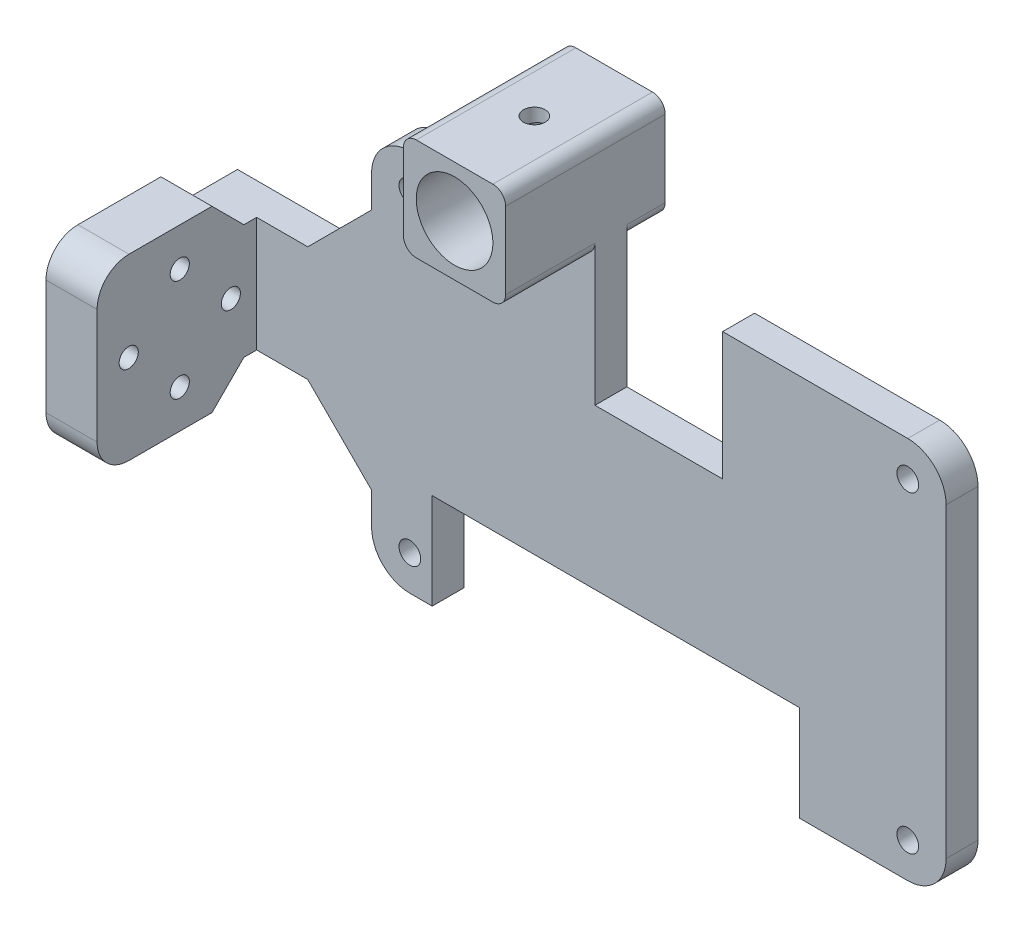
ISO-10303-21;
HEADER;
FILE_DESCRIPTION(('STEP AP214'),'2;1');
FILE_NAME('part.step','',(''),(''),'','','');
FILE_SCHEMA(('AUTOMOTIVE_DESIGN { 1 0 10303 214 1 1 1 1 }'));
ENDSEC;
DATA;
#1=APPLICATION_CONTEXT('core data for automotive mechanical design processes');
#2=APPLICATION_PROTOCOL_DEFINITION('international standard','automotive_design',2000,#1);
#3=PRODUCT_CONTEXT('',#1,'mechanical');
#4=PRODUCT('Part','Part','',(#3));
#5=PRODUCT_RELATED_PRODUCT_CATEGORY('part','',(#4));
#6=PRODUCT_DEFINITION_FORMATION('','',#4);
#7=PRODUCT_DEFINITION_CONTEXT('part definition',#1,'design');
#8=PRODUCT_DEFINITION('design','',#6,#7);
#9=PRODUCT_DEFINITION_SHAPE('','',#8);
#10=(LENGTH_UNIT() NAMED_UNIT(*) SI_UNIT(.MILLI.,.METRE.));
#11=(NAMED_UNIT(*) PLANE_ANGLE_UNIT() SI_UNIT($,.RADIAN.));
#12=(NAMED_UNIT(*) SI_UNIT($,.STERADIAN.) SOLID_ANGLE_UNIT());
#13=UNCERTAINTY_MEASURE_WITH_UNIT(LENGTH_MEASURE(1.E-05),#10,'distance_accuracy_value','');
#14=(GEOMETRIC_REPRESENTATION_CONTEXT(3) GLOBAL_UNCERTAINTY_ASSIGNED_CONTEXT((#13)) GLOBAL_UNIT_ASSIGNED_CONTEXT((#10,
#11,#12)) REPRESENTATION_CONTEXT('',''));
#15=CARTESIAN_POINT('',(0.,0.,0.));
#16=DIRECTION('',(0.,0.,1.));
#17=DIRECTION('',(1.,0.,0.));
#18=AXIS2_PLACEMENT_3D('',#15,#16,#17);
#19=CARTESIAN_POINT('',(0.,30.,0.));
#20=DIRECTION('',(0.,-1.,0.));
#21=DIRECTION('',(0.,0.,-1.));
#22=AXIS2_PLACEMENT_3D('',#19,#20,#21);
#23=PLANE('',#22);
#24=DIRECTION('',(-1.,0.,0.));
#25=VECTOR('',#24,1.);
#26=CARTESIAN_POINT('',(-45.,30.,0.));
#27=LINE('',#26,#25);
#28=CARTESIAN_POINT('',(-21.,30.,0.));
#29=VERTEX_POINT('',#28);
#30=CARTESIAN_POINT('',(-24.,30.,0.));
#31=VERTEX_POINT('',#30);
#32=EDGE_CURVE('E357',#29,#31,#27,.T.);
#33=ORIENTED_EDGE('',*,*,#32,.T.);
#34=DIRECTION('',(0.,0.,1.));
#35=VECTOR('',#34,1.);
#36=CARTESIAN_POINT('',(-24.,30.,-6.));
#37=LINE('',#36,#35);
#38=CARTESIAN_POINT('',(-24.,30.,-6.));
#39=VERTEX_POINT('',#38);
#40=EDGE_CURVE('E674',#31,#39,#37,.F.);
#41=ORIENTED_EDGE('',*,*,#40,.T.);
#42=DIRECTION('',(-1.,0.,0.));
#43=VECTOR('',#42,1.);
#44=CARTESIAN_POINT('',(-10.,30.,-6.));
#45=LINE('',#44,#43);
#46=CARTESIAN_POINT('',(-21.,30.,-6.));
#47=VERTEX_POINT('',#46);
#48=EDGE_CURVE('E342',#47,#39,#45,.T.);
#49=ORIENTED_EDGE('',*,*,#48,.F.);
#50=DIRECTION('',(0.,0.,1.));
#51=VECTOR('',#50,1.);
#52=CARTESIAN_POINT('',(-21.,30.,0.));
#53=LINE('',#52,#51);
#54=EDGE_CURVE('E349',#47,#29,#53,.T.);
#55=ORIENTED_EDGE('',*,*,#54,.T.);
#56=EDGE_LOOP('',(#33,#41,#49,#55));
#57=FACE_BOUND('',#56,.T.);
#58=ADVANCED_FACE('F37',(#57),#23,.T.);
#59=CARTESIAN_POINT('',(-45.,30.,5.));
#60=DIRECTION('',(0.,-1.,0.));
#61=DIRECTION('',(0.,0.,-1.));
#62=AXIS2_PLACEMENT_3D('',#59,#60,#61);
#63=PLANE('',#62);
#64=DIRECTION('',(0.,0.,1.));
#65=VECTOR('',#64,1.);
#66=CARTESIAN_POINT('',(-26.,30.,-6.));
#67=LINE('',#66,#65);
#68=CARTESIAN_POINT('',(-26.,30.,0.));
#69=VERTEX_POINT('',#68);
#70=CARTESIAN_POINT('',(-26.,30.,5.));
#71=VERTEX_POINT('',#70);
#72=EDGE_CURVE('E375',#69,#71,#67,.T.);
#73=ORIENTED_EDGE('',*,*,#72,.F.);
#74=CARTESIAN_POINT('',(-39.,30.,0.));
#75=VERTEX_POINT('',#74);
#76=EDGE_CURVE('E580',#69,#75,#27,.T.);
#77=ORIENTED_EDGE('',*,*,#76,.T.);
#78=DIRECTION('',(0.,0.,-1.));
#79=VECTOR('',#78,1.);
#80=CARTESIAN_POINT('',(-39.,30.,5.));
#81=LINE('',#80,#79);
#82=CARTESIAN_POINT('',(-39.,30.,5.));
#83=VERTEX_POINT('',#82);
#84=EDGE_CURVE('E610',#75,#83,#81,.F.);
#85=ORIENTED_EDGE('',*,*,#84,.T.);
#86=DIRECTION('',(-1.,0.,0.));
#87=VECTOR('',#86,1.);
#88=CARTESIAN_POINT('',(-45.,30.,5.));
#89=LINE('',#88,#87);
#90=EDGE_CURVE('E563',#71,#83,#89,.T.);
#91=ORIENTED_EDGE('',*,*,#90,.F.);
#92=EDGE_LOOP('',(#73,#77,#85,#91));
#93=FACE_BOUND('',#92,.T.);
#94=ADVANCED_FACE('F767',(#93),#63,.F.);
#95=CARTESIAN_POINT('',(-71.,-9.,5.));
#96=DIRECTION('',(0.,1.,0.));
#97=DIRECTION('',(0.,0.,1.));
#98=AXIS2_PLACEMENT_3D('',#95,#96,#97);
#99=PLANE('',#98);
#100=DIRECTION('',(-1.,0.,0.));
#101=VECTOR('',#100,1.);
#102=CARTESIAN_POINT('',(-63.,-9.,7.00000000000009));
#103=LINE('',#102,#101);
#104=CARTESIAN_POINT('',(-63.,-9.,7.00000000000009));
#105=VERTEX_POINT('',#104);
#106=CARTESIAN_POINT('',(-71.,-9.,7.00000000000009));
#107=VERTEX_POINT('',#106);
#108=EDGE_CURVE('E395',#105,#107,#103,.T.);
#109=ORIENTED_EDGE('',*,*,#108,.T.);
#110=DIRECTION('',(0.,0.,1.));
#111=VECTOR('',#110,1.);
#112=CARTESIAN_POINT('',(-71.,-9.,5.));
#113=LINE('',#112,#111);
#114=CARTESIAN_POINT('',(-71.,-9.,0.));
#115=VERTEX_POINT('',#114);
#116=EDGE_CURVE('E475',#115,#107,#113,.T.);
#117=ORIENTED_EDGE('',*,*,#116,.F.);
#118=DIRECTION('',(1.,0.,0.));
#119=VECTOR('',#118,1.);
#120=CARTESIAN_POINT('',(-71.,-9.,0.));
#121=LINE('',#120,#119);
#122=CARTESIAN_POINT('',(-55.,-9.,0.));
#123=VERTEX_POINT('',#122);
#124=EDGE_CURVE('E480',#115,#123,#121,.T.);
#125=ORIENTED_EDGE('',*,*,#124,.T.);
#126=DIRECTION('',(0.,0.,1.));
#127=VECTOR('',#126,1.);
#128=CARTESIAN_POINT('',(-55.,-9.,5.));
#129=LINE('',#128,#127);
#130=CARTESIAN_POINT('',(-55.,-9.,5.));
#131=VERTEX_POINT('',#130);
#132=EDGE_CURVE('E453',#123,#131,#129,.T.);
#133=ORIENTED_EDGE('',*,*,#132,.T.);
#134=DIRECTION('',(1.,0.,0.));
#135=VECTOR('',#134,1.);
#136=CARTESIAN_POINT('',(-71.,-9.,5.));
#137=LINE('',#136,#135);
#138=CARTESIAN_POINT('',(-63.,-9.,5.));
#139=VERTEX_POINT('',#138);
#140=EDGE_CURVE('E478',#139,#131,#137,.T.);
#141=ORIENTED_EDGE('',*,*,#140,.F.);
#142=DIRECTION('',(0.,0.,-1.));
#143=VECTOR('',#142,1.);
#144=CARTESIAN_POINT('',(-63.,-9.,30.));
#145=LINE('',#144,#143);
#146=EDGE_CURVE('E447',#105,#139,#145,.T.);
#147=ORIENTED_EDGE('',*,*,#146,.F.);
#148=EDGE_LOOP('',(#109,#117,#125,#133,#141,#147));
#149=FACE_BOUND('',#148,.T.);
#150=ADVANCED_FACE('F807',(#149),#99,.F.);
#151=CARTESIAN_POINT('',(-71.,9.,5.));
#152=DIRECTION('',(0.,-1.,0.));
#153=DIRECTION('',(0.,0.,-1.));
#154=AXIS2_PLACEMENT_3D('',#151,#152,#153);
#155=PLANE('',#154);
#156=DIRECTION('',(0.,0.,-1.));
#157=VECTOR('',#156,1.);
#158=CARTESIAN_POINT('',(-71.,9.,5.));
#159=LINE('',#158,#157);
#160=CARTESIAN_POINT('',(-71.,9.,7.00000000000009));
#161=VERTEX_POINT('',#160);
#162=CARTESIAN_POINT('',(-71.,9.,0.));
#163=VERTEX_POINT('',#162);
#164=EDGE_CURVE('E471',#161,#163,#159,.T.);
#165=ORIENTED_EDGE('',*,*,#164,.F.);
#166=DIRECTION('',(-1.,0.,0.));
#167=VECTOR('',#166,1.);
#168=CARTESIAN_POINT('',(-63.,9.,7.00000000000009));
#169=LINE('',#168,#167);
#170=CARTESIAN_POINT('',(-63.,9.,7.00000000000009));
#171=VERTEX_POINT('',#170);
#172=EDGE_CURVE('E402',#171,#161,#169,.T.);
#173=ORIENTED_EDGE('',*,*,#172,.F.);
#174=DIRECTION('',(0.,0.,-1.));
#175=VECTOR('',#174,1.);
#176=CARTESIAN_POINT('',(-63.,9.,30.));
#177=LINE('',#176,#175);
#178=CARTESIAN_POINT('',(-63.,9.,5.));
#179=VERTEX_POINT('',#178);
#180=EDGE_CURVE('E443',#171,#179,#177,.T.);
#181=ORIENTED_EDGE('',*,*,#180,.T.);
#182=DIRECTION('',(1.,0.,0.));
#183=VECTOR('',#182,1.);
#184=CARTESIAN_POINT('',(-71.,9.,5.));
#185=LINE('',#184,#183);
#186=CARTESIAN_POINT('',(-55.,9.,5.));
#187=VERTEX_POINT('',#186);
#188=EDGE_CURVE('E486',#179,#187,#185,.T.);
#189=ORIENTED_EDGE('',*,*,#188,.T.);
#190=DIRECTION('',(0.,0.,1.));
#191=VECTOR('',#190,1.);
#192=CARTESIAN_POINT('',(-55.,9.,5.));
#193=LINE('',#192,#191);
#194=CARTESIAN_POINT('',(-55.,9.,0.));
#195=VERTEX_POINT('',#194);
#196=EDGE_CURVE('E465',#187,#195,#193,.F.);
#197=ORIENTED_EDGE('',*,*,#196,.T.);
#198=DIRECTION('',(1.,0.,0.));
#199=VECTOR('',#198,1.);
#200=CARTESIAN_POINT('',(-71.,9.,0.));
#201=LINE('',#200,#199);
#202=EDGE_CURVE('E483',#163,#195,#201,.T.);
#203=ORIENTED_EDGE('',*,*,#202,.F.);
#204=EDGE_LOOP('',(#165,#173,#181,#189,#197,#203));
#205=FACE_BOUND('',#204,.T.);
#206=ADVANCED_FACE('F1007',(#205),#155,.F.);
#207=CARTESIAN_POINT('',(-45.,30.,5.));
#208=DIRECTION('',(1.,0.,0.));
#209=DIRECTION('',(0.,0.,-1.));
#210=AXIS2_PLACEMENT_3D('',#207,#208,#209);
#211=PLANE('',#210);
#212=DIRECTION('',(0.,-1.,0.));
#213=VECTOR('',#212,1.);
#214=CARTESIAN_POINT('',(-45.,30.,0.));
#215=LINE('',#214,#213);
#216=CARTESIAN_POINT('',(-45.,24.,0.));
#217=VERTEX_POINT('',#216);
#218=CARTESIAN_POINT('',(-45.,19.,0.));
#219=VERTEX_POINT('',#218);
#220=EDGE_CURVE('E586',#217,#219,#215,.T.);
#221=ORIENTED_EDGE('',*,*,#220,.T.);
#222=DIRECTION('',(0.,0.,-1.));
#223=VECTOR('',#222,1.);
#224=CARTESIAN_POINT('',(-45.,19.,5.));
#225=LINE('',#224,#223);
#226=CARTESIAN_POINT('',(-45.,19.,5.));
#227=VERTEX_POINT('',#226);
#228=EDGE_CURVE('E469',#219,#227,#225,.F.);
#229=ORIENTED_EDGE('',*,*,#228,.T.);
#230=DIRECTION('',(0.,-1.,0.));
#231=VECTOR('',#230,1.);
#232=CARTESIAN_POINT('',(-45.,30.,5.));
#233=LINE('',#232,#231);
#234=CARTESIAN_POINT('',(-45.,24.,5.));
#235=VERTEX_POINT('',#234);
#236=EDGE_CURVE('E570',#235,#227,#233,.T.);
#237=ORIENTED_EDGE('',*,*,#236,.F.);
#238=DIRECTION('',(0.,0.,-1.));
#239=VECTOR('',#238,1.);
#240=CARTESIAN_POINT('',(-45.,24.,5.));
#241=LINE('',#240,#239);
#242=EDGE_CURVE('E593',#235,#217,#241,.T.);
#243=ORIENTED_EDGE('',*,*,#242,.T.);
#244=EDGE_LOOP('',(#221,#229,#237,#243));
#245=FACE_BOUND('',#244,.T.);
#246=ADVANCED_FACE('F1095',(#245),#211,.F.);
#247=CARTESIAN_POINT('',(-45.,-19.,5.));
#248=VERTEX_POINT('',#247);
#249=CARTESIAN_POINT('',(-45.,-24.,5.));
#250=VERTEX_POINT('',#249);
#251=EDGE_CURVE('E568',#248,#250,#233,.T.);
#252=ORIENTED_EDGE('',*,*,#251,.F.);
#253=DIRECTION('',(0.,0.,-1.));
#254=VECTOR('',#253,1.);
#255=CARTESIAN_POINT('',(-45.,-19.,5.));
#256=LINE('',#255,#254);
#257=CARTESIAN_POINT('',(-45.,-19.,0.));
#258=VERTEX_POINT('',#257);
#259=EDGE_CURVE('E458',#248,#258,#256,.T.);
#260=ORIENTED_EDGE('',*,*,#259,.T.);
#261=CARTESIAN_POINT('',(-45.,-24.,0.));
#262=VERTEX_POINT('',#261);
#263=EDGE_CURVE('E584',#258,#262,#215,.T.);
#264=ORIENTED_EDGE('',*,*,#263,.T.);
#265=DIRECTION('',(0.,0.,-1.));
#266=VECTOR('',#265,1.);
#267=CARTESIAN_POINT('',(-45.,-24.,5.));
#268=LINE('',#267,#266);
#269=EDGE_CURVE('E577',#262,#250,#268,.F.);
#270=ORIENTED_EDGE('',*,*,#269,.T.);
#271=EDGE_LOOP('',(#252,#260,#264,#270));
#272=FACE_BOUND('',#271,.T.);
#273=ADVANCED_FACE('F1162',(#272),#211,.F.);
#274=CARTESIAN_POINT('',(-45.,-30.,5.));
#275=DIRECTION('',(0.,1.,0.));
#276=DIRECTION('',(0.,0.,1.));
#277=AXIS2_PLACEMENT_3D('',#274,#275,#276);
#278=PLANE('',#277);
#279=DIRECTION('',(1.,0.,0.));
#280=VECTOR('',#279,1.);
#281=CARTESIAN_POINT('',(-45.,-30.,5.));
#282=LINE('',#281,#280);
#283=CARTESIAN_POINT('',(22.,-30.,5.));
#284=VERTEX_POINT('',#283);
#285=CARTESIAN_POINT('',(39.,-30.,5.));
#286=VERTEX_POINT('',#285);
#287=EDGE_CURVE('E573',#284,#286,#282,.T.);
#288=ORIENTED_EDGE('',*,*,#287,.F.);
#289=DIRECTION('',(0.,0.,-1.));
#290=VECTOR('',#289,1.);
#291=CARTESIAN_POINT('',(22.,-30.,5.));
#292=LINE('',#291,#290);
#293=CARTESIAN_POINT('',(22.,-30.,0.));
#294=VERTEX_POINT('',#293);
#295=EDGE_CURVE('E513',#284,#294,#292,.T.);
#296=ORIENTED_EDGE('',*,*,#295,.T.);
#297=DIRECTION('',(1.,0.,0.));
#298=VECTOR('',#297,1.);
#299=CARTESIAN_POINT('',(-45.,-30.,0.));
#300=LINE('',#299,#298);
#301=CARTESIAN_POINT('',(39.,-30.,0.));
#302=VERTEX_POINT('',#301);
#303=EDGE_CURVE('E588',#294,#302,#300,.T.);
#304=ORIENTED_EDGE('',*,*,#303,.T.);
#305=DIRECTION('',(0.,0.,-1.));
#306=VECTOR('',#305,1.);
#307=CARTESIAN_POINT('',(39.,-30.,5.));
#308=LINE('',#307,#306);
#309=EDGE_CURVE('E621',#302,#286,#308,.F.);
#310=ORIENTED_EDGE('',*,*,#309,.T.);
#311=EDGE_LOOP('',(#288,#296,#304,#310));
#312=FACE_BOUND('',#311,.T.);
#313=ADVANCED_FACE('F1176',(#312),#278,.F.);
#314=CARTESIAN_POINT('',(45.,30.,5.));
#315=DIRECTION('',(-1.,0.,0.));
#316=DIRECTION('',(0.,0.,1.));
#317=AXIS2_PLACEMENT_3D('',#314,#315,#316);
#318=PLANE('',#317);
#319=DIRECTION('',(0.,1.,0.));
#320=VECTOR('',#319,1.);
#321=CARTESIAN_POINT('',(45.,30.,5.));
#322=LINE('',#321,#320);
#323=CARTESIAN_POINT('',(45.,-24.,5.));
#324=VERTEX_POINT('',#323);
#325=CARTESIAN_POINT('',(45.,24.,5.));
#326=VERTEX_POINT('',#325);
#327=EDGE_CURVE('E560',#324,#326,#322,.T.);
#328=ORIENTED_EDGE('',*,*,#327,.F.);
#329=DIRECTION('',(0.,0.,-1.));
#330=VECTOR('',#329,1.);
#331=CARTESIAN_POINT('',(45.,-24.,5.));
#332=LINE('',#331,#330);
#333=CARTESIAN_POINT('',(45.,-24.,0.));
#334=VERTEX_POINT('',#333);
#335=EDGE_CURVE('E629',#324,#334,#332,.T.);
#336=ORIENTED_EDGE('',*,*,#335,.T.);
#337=DIRECTION('',(0.,1.,0.));
#338=VECTOR('',#337,1.);
#339=CARTESIAN_POINT('',(45.,30.,0.));
#340=LINE('',#339,#338);
#341=CARTESIAN_POINT('',(45.,24.,0.));
#342=VERTEX_POINT('',#341);
#343=EDGE_CURVE('E551',#334,#342,#340,.T.);
#344=ORIENTED_EDGE('',*,*,#343,.T.);
#345=DIRECTION('',(0.,0.,-1.));
#346=VECTOR('',#345,1.);
#347=CARTESIAN_POINT('',(45.,24.,5.));
#348=LINE('',#347,#346);
#349=EDGE_CURVE('E627',#342,#326,#348,.F.);
#350=ORIENTED_EDGE('',*,*,#349,.T.);
#351=EDGE_LOOP('',(#328,#336,#344,#350));
#352=FACE_BOUND('',#351,.T.);
#353=ADVANCED_FACE('F1242',(#352),#318,.F.);
#354=CARTESIAN_POINT('',(39.,30.,0.));
#355=VERTEX_POINT('',#354);
#356=CARTESIAN_POINT('',(9.99999999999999,30.,0.));
#357=VERTEX_POINT('',#356);
#358=EDGE_CURVE('E581',#355,#357,#27,.T.);
#359=ORIENTED_EDGE('',*,*,#358,.T.);
#360=DIRECTION('',(0.,0.,-1.));
#361=VECTOR('',#360,1.);
#362=CARTESIAN_POINT('',(10.,30.,5.));
#363=LINE('',#362,#361);
#364=CARTESIAN_POINT('',(10.,30.,5.));
#365=VERTEX_POINT('',#364);
#366=EDGE_CURVE('E498',#365,#357,#363,.T.);
#367=ORIENTED_EDGE('',*,*,#366,.F.);
#368=CARTESIAN_POINT('',(39.,30.,5.));
#369=VERTEX_POINT('',#368);
#370=EDGE_CURVE('E565',#369,#365,#89,.T.);
#371=ORIENTED_EDGE('',*,*,#370,.F.);
#372=DIRECTION('',(0.,0.,-1.));
#373=VECTOR('',#372,1.);
#374=CARTESIAN_POINT('',(39.,30.,5.));
#375=LINE('',#374,#373);
#376=EDGE_CURVE('E607',#369,#355,#375,.T.);
#377=ORIENTED_EDGE('',*,*,#376,.T.);
#378=EDGE_LOOP('',(#359,#367,#371,#377));
#379=FACE_BOUND('',#378,.T.);
#380=ADVANCED_FACE('F809',(#379),#63,.F.);
#381=CARTESIAN_POINT('',(-39.,-30.,0.));
#382=VERTEX_POINT('',#381);
#383=CARTESIAN_POINT('',(-35.5,-30.,0.));
#384=VERTEX_POINT('',#383);
#385=EDGE_CURVE('E564',#382,#384,#300,.T.);
#386=ORIENTED_EDGE('',*,*,#385,.T.);
#387=DIRECTION('',(0.,0.,-1.));
#388=VECTOR('',#387,1.);
#389=CARTESIAN_POINT('',(-35.5,-30.,5.));
#390=LINE('',#389,#388);
#391=CARTESIAN_POINT('',(-35.5,-30.,5.));
#392=VERTEX_POINT('',#391);
#393=EDGE_CURVE('E517',#392,#384,#390,.T.);
#394=ORIENTED_EDGE('',*,*,#393,.F.);
#395=CARTESIAN_POINT('',(-39.,-30.,5.));
#396=VERTEX_POINT('',#395);
#397=EDGE_CURVE('E574',#396,#392,#282,.T.);
#398=ORIENTED_EDGE('',*,*,#397,.F.);
#399=DIRECTION('',(0.,0.,-1.));
#400=VECTOR('',#399,1.);
#401=CARTESIAN_POINT('',(-39.,-30.,5.));
#402=LINE('',#401,#400);
#403=EDGE_CURVE('E624',#396,#382,#402,.T.);
#404=ORIENTED_EDGE('',*,*,#403,.T.);
#405=EDGE_LOOP('',(#386,#394,#398,#404));
#406=FACE_BOUND('',#405,.T.);
#407=ADVANCED_FACE('F1245',(#406),#278,.F.);
#408=CARTESIAN_POINT('',(0.,0.,5.));
#409=DIRECTION('',(0.,0.,1.));
#410=DIRECTION('',(1.,0.,0.));
#411=AXIS2_PLACEMENT_3D('',#408,#409,#410);
#412=PLANE('',#411);
#413=DIRECTION('',(0.,1.,0.));
#414=VECTOR('',#413,1.);
#415=CARTESIAN_POINT('',(-10.,30.,5.));
#416=LINE('',#415,#414);
#417=CARTESIAN_POINT('',(-10.,9.99999999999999,5.));
#418=VERTEX_POINT('',#417);
#419=CARTESIAN_POINT('',(-10.,32.,5.));
#420=VERTEX_POINT('',#419);
#421=EDGE_CURVE('E496',#418,#420,#416,.T.);
#422=ORIENTED_EDGE('',*,*,#421,.T.);
#423=CARTESIAN_POINT('',(-12.,32.,5.));
#424=DIRECTION('',(0.,0.,1.));
#425=DIRECTION('',(1.,0.,0.));
#426=AXIS2_PLACEMENT_3D('',#423,#424,#425);
#427=CIRCLE('',#426,2.);
#428=CARTESIAN_POINT('',(-12.,30.,5.));
#429=VERTEX_POINT('',#428);
#430=EDGE_CURVE('E11',#420,#429,#427,.F.);
#431=ORIENTED_EDGE('',*,*,#430,.T.);
#432=CARTESIAN_POINT('',(-24.,30.,5.));
#433=VERTEX_POINT('',#432);
#434=EDGE_CURVE('E569',#429,#433,#89,.T.);
#435=ORIENTED_EDGE('',*,*,#434,.T.);
#436=CARTESIAN_POINT('',(-24.,32.,5.));
#437=DIRECTION('',(0.,0.,1.));
#438=DIRECTION('',(1.,0.,0.));
#439=AXIS2_PLACEMENT_3D('',#436,#437,#438);
#440=CIRCLE('',#439,2.);
#441=CARTESIAN_POINT('',(-26.,32.,5.));
#442=VERTEX_POINT('',#441);
#443=EDGE_CURVE('E51',#433,#442,#440,.F.);
#444=ORIENTED_EDGE('',*,*,#443,.T.);
#445=DIRECTION('',(0.,1.,0.));
#446=VECTOR('',#445,1.);
#447=CARTESIAN_POINT('',(-26.,0.,5.));
#448=LINE('',#447,#446);
#449=EDGE_CURVE('E58',#71,#442,#448,.T.);
#450=ORIENTED_EDGE('',*,*,#449,.F.);
#451=ORIENTED_EDGE('',*,*,#90,.T.);
#452=CARTESIAN_POINT('',(-39.,24.,5.));
#453=DIRECTION('',(0.,0.,1.));
#454=DIRECTION('',(1.,0.,0.));
#455=AXIS2_PLACEMENT_3D('',#452,#453,#454);
#456=CIRCLE('',#455,6.);
#457=EDGE_CURVE('E619',#83,#235,#456,.T.);
#458=ORIENTED_EDGE('',*,*,#457,.T.);
#459=ORIENTED_EDGE('',*,*,#236,.T.);
#460=DIRECTION('',(-0.707106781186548,-0.707106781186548,0.));
#461=VECTOR('',#460,1.);
#462=CARTESIAN_POINT('',(-45.,19.,5.));
#463=LINE('',#462,#461);
#464=EDGE_CURVE('E461',#227,#187,#463,.T.);
#465=ORIENTED_EDGE('',*,*,#464,.T.);
#466=ORIENTED_EDGE('',*,*,#188,.F.);
#467=DIRECTION('',(0.,1.,0.));
#468=VECTOR('',#467,1.);
#469=CARTESIAN_POINT('',(-63.,9.,5.));
#470=LINE('',#469,#468);
#471=EDGE_CURVE('E436',#139,#179,#470,.T.);
#472=ORIENTED_EDGE('',*,*,#471,.F.);
#473=ORIENTED_EDGE('',*,*,#140,.T.);
#474=DIRECTION('',(-0.707106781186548,0.707106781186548,0.));
#475=VECTOR('',#474,1.);
#476=CARTESIAN_POINT('',(-45.,-19.,5.));
#477=LINE('',#476,#475);
#478=EDGE_CURVE('E449',#248,#131,#477,.T.);
#479=ORIENTED_EDGE('',*,*,#478,.F.);
#480=ORIENTED_EDGE('',*,*,#251,.T.);
#481=CARTESIAN_POINT('',(-39.,-24.,5.));
#482=DIRECTION('',(0.,0.,1.));
#483=DIRECTION('',(1.,0.,0.));
#484=AXIS2_PLACEMENT_3D('',#481,#482,#483);
#485=CIRCLE('',#484,6.);
#486=EDGE_CURVE('E617',#250,#396,#485,.T.);
#487=ORIENTED_EDGE('',*,*,#486,.T.);
#488=ORIENTED_EDGE('',*,*,#397,.T.);
#489=DIRECTION('',(0.,1.,0.));
#490=VECTOR('',#489,1.);
#491=CARTESIAN_POINT('',(-35.5,-15.,5.));
#492=LINE('',#491,#490);
#493=CARTESIAN_POINT('',(-35.5,-15.,5.));
#494=VERTEX_POINT('',#493);
#495=EDGE_CURVE('E532',#392,#494,#492,.T.);
#496=ORIENTED_EDGE('',*,*,#495,.T.);
#497=DIRECTION('',(1.,0.,0.));
#498=VECTOR('',#497,1.);
#499=CARTESIAN_POINT('',(22.,-15.,5.));
#500=LINE('',#499,#498);
#501=CARTESIAN_POINT('',(22.,-15.,5.));
#502=VERTEX_POINT('',#501);
#503=EDGE_CURVE('E516',#494,#502,#500,.T.);
#504=ORIENTED_EDGE('',*,*,#503,.T.);
#505=DIRECTION('',(0.,-1.,0.));
#506=VECTOR('',#505,1.);
#507=CARTESIAN_POINT('',(22.,-15.,5.));
#508=LINE('',#507,#506);
#509=EDGE_CURVE('E527',#502,#284,#508,.T.);
#510=ORIENTED_EDGE('',*,*,#509,.T.);
#511=ORIENTED_EDGE('',*,*,#287,.T.);
#512=CARTESIAN_POINT('',(39.,-24.,5.));
#513=DIRECTION('',(0.,0.,1.));
#514=DIRECTION('',(1.,0.,0.));
#515=AXIS2_PLACEMENT_3D('',#512,#513,#514);
#516=CIRCLE('',#515,6.);
#517=EDGE_CURVE('E615',#286,#324,#516,.T.);
#518=ORIENTED_EDGE('',*,*,#517,.T.);
#519=ORIENTED_EDGE('',*,*,#327,.T.);
#520=CARTESIAN_POINT('',(39.,24.,5.));
#521=DIRECTION('',(0.,0.,1.));
#522=DIRECTION('',(1.,0.,0.));
#523=AXIS2_PLACEMENT_3D('',#520,#521,#522);
#524=CIRCLE('',#523,6.);
#525=EDGE_CURVE('E613',#326,#369,#524,.T.);
#526=ORIENTED_EDGE('',*,*,#525,.T.);
#527=ORIENTED_EDGE('',*,*,#370,.T.);
#528=DIRECTION('',(0.,-1.,0.));
#529=VECTOR('',#528,1.);
#530=CARTESIAN_POINT('',(10.,30.,5.));
#531=LINE('',#530,#529);
#532=CARTESIAN_POINT('',(10.,9.99999999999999,5.));
#533=VERTEX_POINT('',#532);
#534=EDGE_CURVE('E489',#365,#533,#531,.T.);
#535=ORIENTED_EDGE('',*,*,#534,.T.);
#536=DIRECTION('',(-1.,0.,0.));
#537=VECTOR('',#536,1.);
#538=CARTESIAN_POINT('',(10.,9.99999999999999,5.));
#539=LINE('',#538,#537);
#540=EDGE_CURVE('E492',#533,#418,#539,.T.);
#541=ORIENTED_EDGE('',*,*,#540,.T.);
#542=EDGE_LOOP('',(#422,#431,#435,#444,#450,#451,#458,#459,#465,#466,#472,#473,#479,#480,#487,
#488,#496,#504,#510,#511,#518,#519,#526,#527,#535,#541));
#543=FACE_BOUND('',#542,.T.);
#544=CARTESIAN_POINT('',(-39.,-24.5,5.));
#545=DIRECTION('',(0.,0.,1.));
#546=DIRECTION('',(-1.,0.,0.));
#547=AXIS2_PLACEMENT_3D('',#544,#545,#546);
#548=CIRCLE('',#547,1.7);
#549=CARTESIAN_POINT('',(-40.7,-24.5,5.));
#550=VERTEX_POINT('',#549);
#551=EDGE_CURVE('E543',#550,#550,#548,.T.);
#552=ORIENTED_EDGE('',*,*,#551,.F.);
#553=EDGE_LOOP('',(#552));
#554=FACE_BOUND('',#553,.T.);
#555=CARTESIAN_POINT('',(-39.,24.5,5.));
#556=DIRECTION('',(0.,0.,-1.));
#557=DIRECTION('',(-1.,0.,0.));
#558=AXIS2_PLACEMENT_3D('',#555,#556,#557);
#559=CIRCLE('',#558,1.7);
#560=CARTESIAN_POINT('',(-40.7,24.5,5.));
#561=VERTEX_POINT('',#560);
#562=EDGE_CURVE('E539',#561,#561,#559,.T.);
#563=ORIENTED_EDGE('',*,*,#562,.T.);
#564=EDGE_LOOP('',(#563));
#565=FACE_BOUND('',#564,.T.);
#566=CARTESIAN_POINT('',(39.,-24.5,5.));
#567=DIRECTION('',(0.,0.,1.));
#568=DIRECTION('',(-1.,0.,0.));
#569=AXIS2_PLACEMENT_3D('',#566,#567,#568);
#570=CIRCLE('',#569,1.7);
#571=CARTESIAN_POINT('',(37.3,-24.5,5.));
#572=VERTEX_POINT('',#571);
#573=EDGE_CURVE('E536',#572,#572,#570,.T.);
#574=ORIENTED_EDGE('',*,*,#573,.F.);
#575=EDGE_LOOP('',(#574));
#576=FACE_BOUND('',#575,.T.);
#577=CARTESIAN_POINT('',(39.,24.5,5.));
#578=DIRECTION('',(0.,0.,-1.));
#579=DIRECTION('',(-1.,0.,0.));
#580=AXIS2_PLACEMENT_3D('',#577,#578,#579);
#581=CIRCLE('',#580,1.7);
#582=CARTESIAN_POINT('',(37.3,24.5,5.));
#583=VERTEX_POINT('',#582);
#584=EDGE_CURVE('E548',#583,#583,#581,.T.);
#585=ORIENTED_EDGE('',*,*,#584,.T.);
#586=EDGE_LOOP('',(#585));
#587=FACE_BOUND('',#586,.T.);
#588=ADVANCED_FACE('F717',(#543,#554,#565,#576,#587),#412,.T.);
#589=CARTESIAN_POINT('',(0.,0.,0.));
#590=DIRECTION('',(0.,0.,1.));
#591=DIRECTION('',(1.,0.,0.));
#592=AXIS2_PLACEMENT_3D('',#589,#590,#591);
#593=PLANE('',#592);
#594=DIRECTION('',(-1.,0.,0.));
#595=VECTOR('',#594,1.);
#596=CARTESIAN_POINT('',(0.,23.9999999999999,0.));
#597=LINE('',#596,#595);
#598=CARTESIAN_POINT('',(-21.,23.9999999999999,0.));
#599=VERTEX_POINT('',#598);
#600=CARTESIAN_POINT('',(-15.,23.9999999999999,0.));
#601=VERTEX_POINT('',#600);
#602=EDGE_CURVE('E331',#599,#601,#597,.F.);
#603=ORIENTED_EDGE('',*,*,#602,.T.);
#604=DIRECTION('',(0.,1.,0.));
#605=VECTOR('',#604,1.);
#606=CARTESIAN_POINT('',(-15.,0.,0.));
#607=LINE('',#606,#605);
#608=CARTESIAN_POINT('',(-15.,30.,-2.70313285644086E-12));
#609=VERTEX_POINT('',#608);
#610=EDGE_CURVE('E343',#601,#609,#607,.T.);
#611=ORIENTED_EDGE('',*,*,#610,.T.);
#612=CARTESIAN_POINT('',(-12.,30.,0.));
#613=VERTEX_POINT('',#612);
#614=EDGE_CURVE('E585',#613,#609,#27,.T.);
#615=ORIENTED_EDGE('',*,*,#614,.F.);
#616=CARTESIAN_POINT('',(-12.,32.,0.));
#617=DIRECTION('',(0.,0.,1.));
#618=DIRECTION('',(1.,0.,0.));
#619=AXIS2_PLACEMENT_3D('',#616,#617,#618);
#620=CIRCLE('',#619,2.);
#621=CARTESIAN_POINT('',(-10.,32.,0.));
#622=VERTEX_POINT('',#621);
#623=EDGE_CURVE('E713',#613,#622,#620,.T.);
#624=ORIENTED_EDGE('',*,*,#623,.T.);
#625=DIRECTION('',(0.,1.,0.));
#626=VECTOR('',#625,1.);
#627=CARTESIAN_POINT('',(-10.,30.,0.));
#628=LINE('',#627,#626);
#629=CARTESIAN_POINT('',(-10.,9.99999999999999,0.));
#630=VERTEX_POINT('',#629);
#631=EDGE_CURVE('E493',#630,#622,#628,.T.);
#632=ORIENTED_EDGE('',*,*,#631,.F.);
#633=DIRECTION('',(-1.,0.,0.));
#634=VECTOR('',#633,1.);
#635=CARTESIAN_POINT('',(10.,9.99999999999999,0.));
#636=LINE('',#635,#634);
#637=CARTESIAN_POINT('',(10.,9.99999999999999,0.));
#638=VERTEX_POINT('',#637);
#639=EDGE_CURVE('E502',#638,#630,#636,.T.);
#640=ORIENTED_EDGE('',*,*,#639,.F.);
#641=DIRECTION('',(0.,-1.,0.));
#642=VECTOR('',#641,1.);
#643=CARTESIAN_POINT('',(10.,30.,0.));
#644=LINE('',#643,#642);
#645=EDGE_CURVE('E499',#357,#638,#644,.T.);
#646=ORIENTED_EDGE('',*,*,#645,.F.);
#647=ORIENTED_EDGE('',*,*,#358,.F.);
#648=CARTESIAN_POINT('',(39.,24.,0.));
#649=DIRECTION('',(0.,0.,1.));
#650=DIRECTION('',(1.,0.,0.));
#651=AXIS2_PLACEMENT_3D('',#648,#649,#650);
#652=CIRCLE('',#651,6.);
#653=EDGE_CURVE('E596',#355,#342,#652,.F.);
#654=ORIENTED_EDGE('',*,*,#653,.T.);
#655=ORIENTED_EDGE('',*,*,#343,.F.);
#656=CARTESIAN_POINT('',(39.,-24.,0.));
#657=DIRECTION('',(0.,0.,1.));
#658=DIRECTION('',(1.,0.,0.));
#659=AXIS2_PLACEMENT_3D('',#656,#657,#658);
#660=CIRCLE('',#659,6.);
#661=EDGE_CURVE('E598',#334,#302,#660,.F.);
#662=ORIENTED_EDGE('',*,*,#661,.T.);
#663=ORIENTED_EDGE('',*,*,#303,.F.);
#664=DIRECTION('',(0.,-1.,0.));
#665=VECTOR('',#664,1.);
#666=CARTESIAN_POINT('',(22.,-15.,0.));
#667=LINE('',#666,#665);
#668=CARTESIAN_POINT('',(22.,-15.,0.));
#669=VERTEX_POINT('',#668);
#670=EDGE_CURVE('E503',#669,#294,#667,.T.);
#671=ORIENTED_EDGE('',*,*,#670,.F.);
#672=DIRECTION('',(1.,0.,0.));
#673=VECTOR('',#672,1.);
#674=CARTESIAN_POINT('',(22.,-15.,0.));
#675=LINE('',#674,#673);
#676=CARTESIAN_POINT('',(-35.5,-15.,0.));
#677=VERTEX_POINT('',#676);
#678=EDGE_CURVE('E523',#677,#669,#675,.T.);
#679=ORIENTED_EDGE('',*,*,#678,.F.);
#680=DIRECTION('',(0.,1.,0.));
#681=VECTOR('',#680,1.);
#682=CARTESIAN_POINT('',(-35.5,-15.,0.));
#683=LINE('',#682,#681);
#684=EDGE_CURVE('E526',#384,#677,#683,.T.);
#685=ORIENTED_EDGE('',*,*,#684,.F.);
#686=ORIENTED_EDGE('',*,*,#385,.F.);
#687=CARTESIAN_POINT('',(-39.,-24.,0.));
#688=DIRECTION('',(0.,0.,1.));
#689=DIRECTION('',(1.,0.,0.));
#690=AXIS2_PLACEMENT_3D('',#687,#688,#689);
#691=CIRCLE('',#690,6.);
#692=EDGE_CURVE('E601',#382,#262,#691,.F.);
#693=ORIENTED_EDGE('',*,*,#692,.T.);
#694=ORIENTED_EDGE('',*,*,#263,.F.);
#695=DIRECTION('',(-0.707106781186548,0.707106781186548,0.));
#696=VECTOR('',#695,1.);
#697=CARTESIAN_POINT('',(-45.,-19.,0.));
#698=LINE('',#697,#696);
#699=EDGE_CURVE('E450',#258,#123,#698,.T.);
#700=ORIENTED_EDGE('',*,*,#699,.T.);
#701=ORIENTED_EDGE('',*,*,#124,.F.);
#702=DIRECTION('',(0.,-1.,0.));
#703=VECTOR('',#702,1.);
#704=CARTESIAN_POINT('',(-71.,9.,0.));
#705=LINE('',#704,#703);
#706=EDGE_CURVE('E473',#163,#115,#705,.T.);
#707=ORIENTED_EDGE('',*,*,#706,.F.);
#708=ORIENTED_EDGE('',*,*,#202,.T.);
#709=DIRECTION('',(-0.707106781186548,-0.707106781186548,0.));
#710=VECTOR('',#709,1.);
#711=CARTESIAN_POINT('',(-45.,19.,0.));
#712=LINE('',#711,#710);
#713=EDGE_CURVE('E462',#219,#195,#712,.T.);
#714=ORIENTED_EDGE('',*,*,#713,.F.);
#715=ORIENTED_EDGE('',*,*,#220,.F.);
#716=CARTESIAN_POINT('',(-39.,24.,0.));
#717=DIRECTION('',(0.,0.,1.));
#718=DIRECTION('',(1.,0.,0.));
#719=AXIS2_PLACEMENT_3D('',#716,#717,#718);
#720=CIRCLE('',#719,6.);
#721=EDGE_CURVE('E604',#217,#75,#720,.F.);
#722=ORIENTED_EDGE('',*,*,#721,.T.);
#723=ORIENTED_EDGE('',*,*,#76,.F.);
#724=DIRECTION('',(0.,-1.,0.));
#725=VECTOR('',#724,1.);
#726=CARTESIAN_POINT('',(-26.,46.,0.));
#727=LINE('',#726,#725);
#728=CARTESIAN_POINT('',(-26.,32.,0.));
#729=VERTEX_POINT('',#728);
#730=EDGE_CURVE('E669',#729,#69,#727,.T.);
#731=ORIENTED_EDGE('',*,*,#730,.F.);
#732=CARTESIAN_POINT('',(-24.,32.,0.));
#733=DIRECTION('',(0.,0.,1.));
#734=DIRECTION('',(1.,0.,0.));
#735=AXIS2_PLACEMENT_3D('',#732,#733,#734);
#736=CIRCLE('',#735,2.);
#737=EDGE_CURVE('E711',#729,#31,#736,.T.);
#738=ORIENTED_EDGE('',*,*,#737,.T.);
#739=ORIENTED_EDGE('',*,*,#32,.F.);
#740=DIRECTION('',(0.,1.,0.));
#741=VECTOR('',#740,1.);
#742=CARTESIAN_POINT('',(-21.,0.,0.));
#743=LINE('',#742,#741);
#744=EDGE_CURVE('E347',#599,#29,#743,.T.);
#745=ORIENTED_EDGE('',*,*,#744,.F.);
#746=EDGE_LOOP('',(#603,#611,#615,#624,#632,#640,#646,#647,#654,#655,#662,#663,#671,#679,#685,
#686,#693,#694,#700,#701,#707,#708,#714,#715,#722,#723,#731,#738,#739,#745));
#747=FACE_BOUND('',#746,.T.);
#748=CARTESIAN_POINT('',(-39.,-24.5,0.));
#749=DIRECTION('',(0.,0.,1.));
#750=DIRECTION('',(-1.,0.,0.));
#751=AXIS2_PLACEMENT_3D('',#748,#749,#750);
#752=CIRCLE('',#751,1.7);
#753=CARTESIAN_POINT('',(-40.7,-24.5,0.));
#754=VERTEX_POINT('',#753);
#755=EDGE_CURVE('E509',#754,#754,#752,.T.);
#756=ORIENTED_EDGE('',*,*,#755,.T.);
#757=EDGE_LOOP('',(#756));
#758=FACE_BOUND('',#757,.T.);
#759=CARTESIAN_POINT('',(-39.,24.5,0.));
#760=DIRECTION('',(0.,0.,-1.));
#761=DIRECTION('',(-1.,0.,0.));
#762=AXIS2_PLACEMENT_3D('',#759,#760,#761);
#763=CIRCLE('',#762,1.7);
#764=CARTESIAN_POINT('',(-40.7,24.5,0.));
#765=VERTEX_POINT('',#764);
#766=EDGE_CURVE('E555',#765,#765,#763,.T.);
#767=ORIENTED_EDGE('',*,*,#766,.F.);
#768=EDGE_LOOP('',(#767));
#769=FACE_BOUND('',#768,.T.);
#770=CARTESIAN_POINT('',(39.,-24.5,0.));
#771=DIRECTION('',(0.,0.,1.));
#772=DIRECTION('',(-1.,0.,0.));
#773=AXIS2_PLACEMENT_3D('',#770,#771,#772);
#774=CIRCLE('',#773,1.7);
#775=CARTESIAN_POINT('',(37.3,-24.5,0.));
#776=VERTEX_POINT('',#775);
#777=EDGE_CURVE('E540',#776,#776,#774,.T.);
#778=ORIENTED_EDGE('',*,*,#777,.T.);
#779=EDGE_LOOP('',(#778));
#780=FACE_BOUND('',#779,.T.);
#781=CARTESIAN_POINT('',(39.,24.5,0.));
#782=DIRECTION('',(0.,0.,-1.));
#783=DIRECTION('',(-1.,0.,0.));
#784=AXIS2_PLACEMENT_3D('',#781,#782,#783);
#785=CIRCLE('',#784,1.7);
#786=CARTESIAN_POINT('',(37.3,24.5,0.));
#787=VERTEX_POINT('',#786);
#788=EDGE_CURVE('E552',#787,#787,#785,.T.);
#789=ORIENTED_EDGE('',*,*,#788,.F.);
#790=EDGE_LOOP('',(#789));
#791=FACE_BOUND('',#790,.T.);
#792=ADVANCED_FACE('F354',(#747,#758,#769,#780,#791),#593,.F.);
#793=CARTESIAN_POINT('',(-39.,24.5,5.));
#794=DIRECTION('',(0.,0.,-1.));
#795=DIRECTION('',(-1.,0.,0.));
#796=AXIS2_PLACEMENT_3D('',#793,#794,#795);
#797=CYLINDRICAL_SURFACE('',#796,1.7);
#798=ORIENTED_EDGE('',*,*,#766,.T.);
#799=EDGE_LOOP('',(#798));
#800=FACE_BOUND('',#799,.T.);
#801=ORIENTED_EDGE('',*,*,#562,.F.);
#802=EDGE_LOOP('',(#801));
#803=FACE_BOUND('',#802,.T.);
#804=ADVANCED_FACE('F1313',(#800,#803),#797,.F.);
#805=CARTESIAN_POINT('',(39.,24.5,5.));
#806=DIRECTION('',(0.,0.,-1.));
#807=DIRECTION('',(-1.,0.,0.));
#808=AXIS2_PLACEMENT_3D('',#805,#806,#807);
#809=CYLINDRICAL_SURFACE('',#808,1.7);
#810=ORIENTED_EDGE('',*,*,#584,.F.);
#811=EDGE_LOOP('',(#810));
#812=FACE_BOUND('',#811,.T.);
#813=ORIENTED_EDGE('',*,*,#788,.T.);
#814=EDGE_LOOP('',(#813));
#815=FACE_BOUND('',#814,.T.);
#816=ADVANCED_FACE('F1304',(#812,#815),#809,.F.);
#817=CARTESIAN_POINT('',(-39.,-24.5,5.));
#818=DIRECTION('',(0.,0.,-1.));
#819=DIRECTION('',(-1.,0.,0.));
#820=AXIS2_PLACEMENT_3D('',#817,#818,#819);
#821=CYLINDRICAL_SURFACE('',#820,1.7);
#822=ORIENTED_EDGE('',*,*,#755,.F.);
#823=EDGE_LOOP('',(#822));
#824=FACE_BOUND('',#823,.T.);
#825=ORIENTED_EDGE('',*,*,#551,.T.);
#826=EDGE_LOOP('',(#825));
#827=FACE_BOUND('',#826,.T.);
#828=ADVANCED_FACE('F1294',(#824,#827),#821,.F.);
#829=CARTESIAN_POINT('',(39.,-24.5,5.));
#830=DIRECTION('',(0.,0.,-1.));
#831=DIRECTION('',(-1.,0.,0.));
#832=AXIS2_PLACEMENT_3D('',#829,#830,#831);
#833=CYLINDRICAL_SURFACE('',#832,1.7);
#834=ORIENTED_EDGE('',*,*,#573,.T.);
#835=EDGE_LOOP('',(#834));
#836=FACE_BOUND('',#835,.T.);
#837=ORIENTED_EDGE('',*,*,#777,.F.);
#838=EDGE_LOOP('',(#837));
#839=FACE_BOUND('',#838,.T.);
#840=ADVANCED_FACE('F1284',(#836,#839),#833,.F.);
#841=CARTESIAN_POINT('',(-39.,24.,5.));
#842=DIRECTION('',(0.,0.,-1.));
#843=DIRECTION('',(-1.,0.,0.));
#844=AXIS2_PLACEMENT_3D('',#841,#842,#843);
#845=CYLINDRICAL_SURFACE('',#844,6.);
#846=ORIENTED_EDGE('',*,*,#457,.F.);
#847=ORIENTED_EDGE('',*,*,#84,.F.);
#848=ORIENTED_EDGE('',*,*,#721,.F.);
#849=ORIENTED_EDGE('',*,*,#242,.F.);
#850=EDGE_LOOP('',(#846,#847,#848,#849));
#851=FACE_BOUND('',#850,.T.);
#852=ADVANCED_FACE('F1274',(#851),#845,.T.);
#853=CARTESIAN_POINT('',(-39.,-24.,5.));
#854=DIRECTION('',(0.,0.,-1.));
#855=DIRECTION('',(-1.,0.,0.));
#856=AXIS2_PLACEMENT_3D('',#853,#854,#855);
#857=CYLINDRICAL_SURFACE('',#856,6.);
#858=ORIENTED_EDGE('',*,*,#486,.F.);
#859=ORIENTED_EDGE('',*,*,#269,.F.);
#860=ORIENTED_EDGE('',*,*,#692,.F.);
#861=ORIENTED_EDGE('',*,*,#403,.F.);
#862=EDGE_LOOP('',(#858,#859,#860,#861));
#863=FACE_BOUND('',#862,.T.);
#864=ADVANCED_FACE('F1264',(#863),#857,.T.);
#865=CARTESIAN_POINT('',(39.,-24.,5.));
#866=DIRECTION('',(0.,0.,-1.));
#867=DIRECTION('',(-1.,0.,0.));
#868=AXIS2_PLACEMENT_3D('',#865,#866,#867);
#869=CYLINDRICAL_SURFACE('',#868,6.);
#870=ORIENTED_EDGE('',*,*,#517,.F.);
#871=ORIENTED_EDGE('',*,*,#309,.F.);
#872=ORIENTED_EDGE('',*,*,#661,.F.);
#873=ORIENTED_EDGE('',*,*,#335,.F.);
#874=EDGE_LOOP('',(#870,#871,#872,#873));
#875=FACE_BOUND('',#874,.T.);
#876=ADVANCED_FACE('F1255',(#875),#869,.T.);
#877=CARTESIAN_POINT('',(39.,24.,5.));
#878=DIRECTION('',(0.,0.,-1.));
#879=DIRECTION('',(-1.,0.,0.));
#880=AXIS2_PLACEMENT_3D('',#877,#878,#879);
#881=CYLINDRICAL_SURFACE('',#880,6.);
#882=ORIENTED_EDGE('',*,*,#525,.F.);
#883=ORIENTED_EDGE('',*,*,#349,.F.);
#884=ORIENTED_EDGE('',*,*,#653,.F.);
#885=ORIENTED_EDGE('',*,*,#376,.F.);
#886=EDGE_LOOP('',(#882,#883,#884,#885));
#887=FACE_BOUND('',#886,.T.);
#888=ADVANCED_FACE('F1231',(#887),#881,.T.);
#889=CARTESIAN_POINT('',(22.,-15.,5.));
#890=DIRECTION('',(1.,0.,0.));
#891=DIRECTION('',(0.,1.,0.));
#892=AXIS2_PLACEMENT_3D('',#889,#890,#891);
#893=PLANE('',#892);
#894=ORIENTED_EDGE('',*,*,#670,.T.);
#895=ORIENTED_EDGE('',*,*,#295,.F.);
#896=ORIENTED_EDGE('',*,*,#509,.F.);
#897=DIRECTION('',(0.,0.,-1.));
#898=VECTOR('',#897,1.);
#899=CARTESIAN_POINT('',(22.,-15.,5.));
#900=LINE('',#899,#898);
#901=EDGE_CURVE('E488',#502,#669,#900,.T.);
#902=ORIENTED_EDGE('',*,*,#901,.T.);
#903=EDGE_LOOP('',(#894,#895,#896,#902));
#904=FACE_BOUND('',#903,.T.);
#905=ADVANCED_FACE('F1221',(#904),#893,.F.);
#906=CARTESIAN_POINT('',(22.,-15.,5.));
#907=DIRECTION('',(0.,1.,0.));
#908=DIRECTION('',(0.,0.,1.));
#909=AXIS2_PLACEMENT_3D('',#906,#907,#908);
#910=PLANE('',#909);
#911=ORIENTED_EDGE('',*,*,#678,.T.);
#912=ORIENTED_EDGE('',*,*,#901,.F.);
#913=ORIENTED_EDGE('',*,*,#503,.F.);
#914=DIRECTION('',(0.,0.,-1.));
#915=VECTOR('',#914,1.);
#916=CARTESIAN_POINT('',(-35.5,-15.,5.));
#917=LINE('',#916,#915);
#918=EDGE_CURVE('E519',#494,#677,#917,.T.);
#919=ORIENTED_EDGE('',*,*,#918,.T.);
#920=EDGE_LOOP('',(#911,#912,#913,#919));
#921=FACE_BOUND('',#920,.T.);
#922=ADVANCED_FACE('F1211',(#921),#910,.F.);
#923=CARTESIAN_POINT('',(-35.5,-15.,5.));
#924=DIRECTION('',(-1.,0.,0.));
#925=DIRECTION('',(0.,0.,1.));
#926=AXIS2_PLACEMENT_3D('',#923,#924,#925);
#927=PLANE('',#926);
#928=ORIENTED_EDGE('',*,*,#684,.T.);
#929=ORIENTED_EDGE('',*,*,#918,.F.);
#930=ORIENTED_EDGE('',*,*,#495,.F.);
#931=ORIENTED_EDGE('',*,*,#393,.T.);
#932=EDGE_LOOP('',(#928,#929,#930,#931));
#933=FACE_BOUND('',#932,.T.);
#934=ADVANCED_FACE('F1203',(#933),#927,.F.);
#935=CARTESIAN_POINT('',(-10.,30.,5.));
#936=DIRECTION('',(-1.,0.,0.));
#937=DIRECTION('',(0.,0.,1.));
#938=AXIS2_PLACEMENT_3D('',#935,#936,#937);
#939=PLANE('',#938);
#940=ORIENTED_EDGE('',*,*,#631,.T.);
#941=DIRECTION('',(0.,0.,-1.));
#942=VECTOR('',#941,1.);
#943=CARTESIAN_POINT('',(-10.,32.,-6.));
#944=LINE('',#943,#942);
#945=CARTESIAN_POINT('',(-10.,32.,-6.));
#946=VERTEX_POINT('',#945);
#947=EDGE_CURVE('E689',#622,#946,#944,.T.);
#948=ORIENTED_EDGE('',*,*,#947,.T.);
#949=DIRECTION('',(0.,-1.,0.));
#950=VECTOR('',#949,1.);
#951=CARTESIAN_POINT('',(-10.,46.,-6.));
#952=LINE('',#951,#950);
#953=CARTESIAN_POINT('',(-10.,44.,-6.));
#954=VERTEX_POINT('',#953);
#955=EDGE_CURVE('E388',#954,#946,#952,.T.);
#956=ORIENTED_EDGE('',*,*,#955,.F.);
#957=DIRECTION('',(0.,0.,-1.));
#958=VECTOR('',#957,1.);
#959=CARTESIAN_POINT('',(-10.,44.,5.));
#960=LINE('',#959,#958);
#961=CARTESIAN_POINT('',(-10.,44.,19.));
#962=VERTEX_POINT('',#961);
#963=EDGE_CURVE('E684',#954,#962,#960,.F.);
#964=ORIENTED_EDGE('',*,*,#963,.T.);
#965=DIRECTION('',(0.,-1.,0.));
#966=VECTOR('',#965,1.);
#967=CARTESIAN_POINT('',(-10.,46.,19.));
#968=LINE('',#967,#966);
#969=CARTESIAN_POINT('',(-10.,32.,19.));
#970=VERTEX_POINT('',#969);
#971=EDGE_CURVE('E372',#962,#970,#968,.T.);
#972=ORIENTED_EDGE('',*,*,#971,.T.);
#973=DIRECTION('',(0.,0.,-1.));
#974=VECTOR('',#973,1.);
#975=CARTESIAN_POINT('',(-10.,32.,5.));
#976=LINE('',#975,#974);
#977=EDGE_CURVE('E686',#970,#420,#976,.T.);
#978=ORIENTED_EDGE('',*,*,#977,.T.);
#979=ORIENTED_EDGE('',*,*,#421,.F.);
#980=DIRECTION('',(0.,0.,-1.));
#981=VECTOR('',#980,1.);
#982=CARTESIAN_POINT('',(-10.,9.99999999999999,5.));
#983=LINE('',#982,#981);
#984=EDGE_CURVE('E507',#418,#630,#983,.T.);
#985=ORIENTED_EDGE('',*,*,#984,.T.);
#986=EDGE_LOOP('',(#940,#948,#956,#964,#972,#978,#979,#985));
#987=FACE_BOUND('',#986,.T.);
#988=ADVANCED_FACE('F739',(#987),#939,.F.);
#989=CARTESIAN_POINT('',(10.,9.99999999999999,5.));
#990=DIRECTION('',(0.,-1.,0.));
#991=DIRECTION('',(0.,0.,-1.));
#992=AXIS2_PLACEMENT_3D('',#989,#990,#991);
#993=PLANE('',#992);
#994=ORIENTED_EDGE('',*,*,#639,.T.);
#995=ORIENTED_EDGE('',*,*,#984,.F.);
#996=ORIENTED_EDGE('',*,*,#540,.F.);
#997=DIRECTION('',(0.,0.,-1.));
#998=VECTOR('',#997,1.);
#999=CARTESIAN_POINT('',(10.,9.99999999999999,5.));
#1000=LINE('',#999,#998);
#1001=EDGE_CURVE('E510',#533,#638,#1000,.T.);
#1002=ORIENTED_EDGE('',*,*,#1001,.T.);
#1003=EDGE_LOOP('',(#994,#995,#996,#1002));
#1004=FACE_BOUND('',#1003,.T.);
#1005=ADVANCED_FACE('F1186',(#1004),#993,.F.);
#1006=CARTESIAN_POINT('',(10.,30.,5.));
#1007=DIRECTION('',(1.,0.,0.));
#1008=DIRECTION('',(0.,0.,-1.));
#1009=AXIS2_PLACEMENT_3D('',#1006,#1007,#1008);
#1010=PLANE('',#1009);
#1011=ORIENTED_EDGE('',*,*,#645,.T.);
#1012=ORIENTED_EDGE('',*,*,#1001,.F.);
#1013=ORIENTED_EDGE('',*,*,#534,.F.);
#1014=ORIENTED_EDGE('',*,*,#366,.T.);
#1015=EDGE_LOOP('',(#1011,#1012,#1013,#1014));
#1016=FACE_BOUND('',#1015,.T.);
#1017=ADVANCED_FACE('F1150',(#1016),#1010,.F.);
#1018=CARTESIAN_POINT('',(-71.,0.,0.));
#1019=DIRECTION('',(1.,0.,0.));
#1020=DIRECTION('',(0.,0.,-1.));
#1021=AXIS2_PLACEMENT_3D('',#1018,#1019,#1020);
#1022=PLANE('',#1021);
#1023=DIRECTION('',(0.,0.,1.));
#1024=VECTOR('',#1023,1.);
#1025=CARTESIAN_POINT('',(-71.,-14.,12.));
#1026=LINE('',#1025,#1024);
#1027=CARTESIAN_POINT('',(-71.,-14.,12.));
#1028=VERTEX_POINT('',#1027);
#1029=CARTESIAN_POINT('',(-71.,-14.,25.));
#1030=VERTEX_POINT('',#1029);
#1031=EDGE_CURVE('E419',#1028,#1030,#1026,.T.);
#1032=ORIENTED_EDGE('',*,*,#1031,.T.);
#1033=CARTESIAN_POINT('',(-71.,-9.,25.));
#1034=DIRECTION('',(1.,0.,0.));
#1035=DIRECTION('',(0.,0.,-1.));
#1036=AXIS2_PLACEMENT_3D('',#1033,#1034,#1035);
#1037=CIRCLE('',#1036,5.);
#1038=CARTESIAN_POINT('',(-71.,-9.,30.));
#1039=VERTEX_POINT('',#1038);
#1040=EDGE_CURVE('E655',#1030,#1039,#1037,.F.);
#1041=ORIENTED_EDGE('',*,*,#1040,.T.);
#1042=DIRECTION('',(0.,-1.,0.));
#1043=VECTOR('',#1042,1.);
#1044=CARTESIAN_POINT('',(-71.,9.,30.));
#1045=LINE('',#1044,#1043);
#1046=CARTESIAN_POINT('',(-71.,9.,30.));
#1047=VERTEX_POINT('',#1046);
#1048=EDGE_CURVE('E437',#1047,#1039,#1045,.T.);
#1049=ORIENTED_EDGE('',*,*,#1048,.F.);
#1050=CARTESIAN_POINT('',(-71.,9.,25.));
#1051=DIRECTION('',(1.,0.,0.));
#1052=DIRECTION('',(0.,0.,-1.));
#1053=AXIS2_PLACEMENT_3D('',#1050,#1051,#1052);
#1054=CIRCLE('',#1053,5.);
#1055=CARTESIAN_POINT('',(-71.,14.,25.));
#1056=VERTEX_POINT('',#1055);
#1057=EDGE_CURVE('E653',#1047,#1056,#1054,.F.);
#1058=ORIENTED_EDGE('',*,*,#1057,.T.);
#1059=DIRECTION('',(0.,0.,1.));
#1060=VECTOR('',#1059,1.);
#1061=CARTESIAN_POINT('',(-71.,14.,12.));
#1062=LINE('',#1061,#1060);
#1063=CARTESIAN_POINT('',(-71.,14.,12.));
#1064=VERTEX_POINT('',#1063);
#1065=EDGE_CURVE('E428',#1064,#1056,#1062,.T.);
#1066=ORIENTED_EDGE('',*,*,#1065,.F.);
#1067=DIRECTION('',(0.,-0.707106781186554,-0.707106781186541));
#1068=VECTOR('',#1067,1.);
#1069=CARTESIAN_POINT('',(-71.,14.,12.));
#1070=LINE('',#1069,#1068);
#1071=EDGE_CURVE('E399',#1064,#161,#1070,.T.);
#1072=ORIENTED_EDGE('',*,*,#1071,.T.);
#1073=ORIENTED_EDGE('',*,*,#164,.T.);
#1074=ORIENTED_EDGE('',*,*,#706,.T.);
#1075=ORIENTED_EDGE('',*,*,#116,.T.);
#1076=DIRECTION('',(0.,0.707106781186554,-0.707106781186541));
#1077=VECTOR('',#1076,1.);
#1078=CARTESIAN_POINT('',(-71.,-14.,12.));
#1079=LINE('',#1078,#1077);
#1080=EDGE_CURVE('E391',#1028,#107,#1079,.T.);
#1081=ORIENTED_EDGE('',*,*,#1080,.F.);
#1082=EDGE_LOOP('',(#1032,#1041,#1049,#1058,#1066,#1072,#1073,#1074,#1075,#1081));
#1083=FACE_BOUND('',#1082,.T.);
#1084=CARTESIAN_POINT('',(-71.,8.,17.0434782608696));
#1085=DIRECTION('',(-1.,0.,0.));
#1086=DIRECTION('',(0.,0.,1.));
#1087=AXIS2_PLACEMENT_3D('',#1084,#1085,#1086);
#1088=CIRCLE('',#1087,1.5);
#1089=CARTESIAN_POINT('',(-71.,8.,18.5434782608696));
#1090=VERTEX_POINT('',#1089);
#1091=EDGE_CURVE('E407',#1090,#1090,#1088,.T.);
#1092=ORIENTED_EDGE('',*,*,#1091,.F.);
#1093=EDGE_LOOP('',(#1092));
#1094=FACE_BOUND('',#1093,.T.);
#1095=CARTESIAN_POINT('',(-71.,0.,25.0434782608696));
#1096=DIRECTION('',(-1.,0.,0.));
#1097=DIRECTION('',(0.,0.,1.));
#1098=AXIS2_PLACEMENT_3D('',#1095,#1096,#1097);
#1099=CIRCLE('',#1098,1.5);
#1100=CARTESIAN_POINT('',(-71.,0.,26.5434782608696));
#1101=VERTEX_POINT('',#1100);
#1102=EDGE_CURVE('E411',#1101,#1101,#1099,.T.);
#1103=ORIENTED_EDGE('',*,*,#1102,.F.);
#1104=EDGE_LOOP('',(#1103));
#1105=FACE_BOUND('',#1104,.T.);
#1106=CARTESIAN_POINT('',(-71.,-8.,17.0434782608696));
#1107=DIRECTION('',(-1.,0.,0.));
#1108=DIRECTION('',(0.,0.,1.));
#1109=AXIS2_PLACEMENT_3D('',#1106,#1107,#1108);
#1110=CIRCLE('',#1109,1.5);
#1111=CARTESIAN_POINT('',(-71.,-8.,18.5434782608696));
#1112=VERTEX_POINT('',#1111);
#1113=EDGE_CURVE('E414',#1112,#1112,#1110,.T.);
#1114=ORIENTED_EDGE('',*,*,#1113,.F.);
#1115=EDGE_LOOP('',(#1114));
#1116=FACE_BOUND('',#1115,.T.);
#1117=CARTESIAN_POINT('',(-71.,0.,9.04347826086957));
#1118=DIRECTION('',(-1.,0.,0.));
#1119=DIRECTION('',(0.,0.,1.));
#1120=AXIS2_PLACEMENT_3D('',#1117,#1118,#1119);
#1121=CIRCLE('',#1120,1.5);
#1122=CARTESIAN_POINT('',(-71.,0.,10.5434782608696));
#1123=VERTEX_POINT('',#1122);
#1124=EDGE_CURVE('E406',#1123,#1123,#1121,.T.);
#1125=ORIENTED_EDGE('',*,*,#1124,.F.);
#1126=EDGE_LOOP('',(#1125));
#1127=FACE_BOUND('',#1126,.T.);
#1128=ADVANCED_FACE('F1138',(#1083,#1094,#1105,#1116,#1127),#1022,.F.);
#1129=CARTESIAN_POINT('',(-45.,19.,0.));
#1130=DIRECTION('',(0.707106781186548,-0.707106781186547,0.));
#1131=DIRECTION('',(-0.707106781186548,-0.707106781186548,0.));
#1132=AXIS2_PLACEMENT_3D('',#1129,#1130,#1131);
#1133=PLANE('',#1132);
#1134=ORIENTED_EDGE('',*,*,#228,.F.);
#1135=ORIENTED_EDGE('',*,*,#713,.T.);
#1136=ORIENTED_EDGE('',*,*,#196,.F.);
#1137=ORIENTED_EDGE('',*,*,#464,.F.);
#1138=EDGE_LOOP('',(#1134,#1135,#1136,#1137));
#1139=FACE_BOUND('',#1138,.T.);
#1140=ADVANCED_FACE('F1127',(#1139),#1133,.F.);
#1141=CARTESIAN_POINT('',(-45.,-19.,0.));
#1142=DIRECTION('',(-0.707106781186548,-0.707106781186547,0.));
#1143=DIRECTION('',(-0.707106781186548,0.707106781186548,0.));
#1144=AXIS2_PLACEMENT_3D('',#1141,#1142,#1143);
#1145=PLANE('',#1144);
#1146=ORIENTED_EDGE('',*,*,#259,.F.);
#1147=ORIENTED_EDGE('',*,*,#478,.T.);
#1148=ORIENTED_EDGE('',*,*,#132,.F.);
#1149=ORIENTED_EDGE('',*,*,#699,.F.);
#1150=EDGE_LOOP('',(#1146,#1147,#1148,#1149));
#1151=FACE_BOUND('',#1150,.T.);
#1152=ADVANCED_FACE('F1116',(#1151),#1145,.T.);
#1153=CARTESIAN_POINT('',(-63.,9.,30.));
#1154=DIRECTION('',(-1.,0.,0.));
#1155=DIRECTION('',(0.,0.,1.));
#1156=AXIS2_PLACEMENT_3D('',#1153,#1154,#1155);
#1157=PLANE('',#1156);
#1158=DIRECTION('',(0.,1.,0.));
#1159=VECTOR('',#1158,1.);
#1160=CARTESIAN_POINT('',(-63.,9.,30.));
#1161=LINE('',#1160,#1159);
#1162=CARTESIAN_POINT('',(-63.,-9.,30.));
#1163=VERTEX_POINT('',#1162);
#1164=CARTESIAN_POINT('',(-63.,9.,30.));
#1165=VERTEX_POINT('',#1164);
#1166=EDGE_CURVE('E440',#1163,#1165,#1161,.T.);
#1167=ORIENTED_EDGE('',*,*,#1166,.F.);
#1168=CARTESIAN_POINT('',(-63.,-9.,25.));
#1169=DIRECTION('',(-1.,0.,0.));
#1170=DIRECTION('',(0.,0.,1.));
#1171=AXIS2_PLACEMENT_3D('',#1168,#1169,#1170);
#1172=CIRCLE('',#1171,5.);
#1173=CARTESIAN_POINT('',(-63.,-14.,25.));
#1174=VERTEX_POINT('',#1173);
#1175=EDGE_CURVE('E649',#1163,#1174,#1172,.F.);
#1176=ORIENTED_EDGE('',*,*,#1175,.T.);
#1177=DIRECTION('',(0.,0.,-1.));
#1178=VECTOR('',#1177,1.);
#1179=CARTESIAN_POINT('',(-63.,-14.,12.));
#1180=LINE('',#1179,#1178);
#1181=CARTESIAN_POINT('',(-63.,-14.,12.));
#1182=VERTEX_POINT('',#1181);
#1183=EDGE_CURVE('E426',#1174,#1182,#1180,.T.);
#1184=ORIENTED_EDGE('',*,*,#1183,.T.);
#1185=DIRECTION('',(0.,0.707106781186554,-0.707106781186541));
#1186=VECTOR('',#1185,1.);
#1187=CARTESIAN_POINT('',(-63.,-14.,12.));
#1188=LINE('',#1187,#1186);
#1189=EDGE_CURVE('E392',#1182,#105,#1188,.T.);
#1190=ORIENTED_EDGE('',*,*,#1189,.T.);
#1191=ORIENTED_EDGE('',*,*,#146,.T.);
#1192=ORIENTED_EDGE('',*,*,#471,.T.);
#1193=ORIENTED_EDGE('',*,*,#180,.F.);
#1194=DIRECTION('',(0.,-0.707106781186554,-0.707106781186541));
#1195=VECTOR('',#1194,1.);
#1196=CARTESIAN_POINT('',(-63.,14.,12.));
#1197=LINE('',#1196,#1195);
#1198=CARTESIAN_POINT('',(-63.,14.,12.));
#1199=VERTEX_POINT('',#1198);
#1200=EDGE_CURVE('E400',#1199,#171,#1197,.T.);
#1201=ORIENTED_EDGE('',*,*,#1200,.F.);
#1202=DIRECTION('',(0.,0.,-1.));
#1203=VECTOR('',#1202,1.);
#1204=CARTESIAN_POINT('',(-63.,14.,12.));
#1205=LINE('',#1204,#1203);
#1206=CARTESIAN_POINT('',(-63.,14.,25.));
#1207=VERTEX_POINT('',#1206);
#1208=EDGE_CURVE('E431',#1207,#1199,#1205,.T.);
#1209=ORIENTED_EDGE('',*,*,#1208,.F.);
#1210=CARTESIAN_POINT('',(-63.,9.,25.));
#1211=DIRECTION('',(-1.,0.,0.));
#1212=DIRECTION('',(0.,0.,1.));
#1213=AXIS2_PLACEMENT_3D('',#1210,#1211,#1212);
#1214=CIRCLE('',#1213,5.);
#1215=EDGE_CURVE('E647',#1207,#1165,#1214,.F.);
#1216=ORIENTED_EDGE('',*,*,#1215,.T.);
#1217=EDGE_LOOP('',(#1167,#1176,#1184,#1190,#1191,#1192,#1193,#1201,#1209,#1216));
#1218=FACE_BOUND('',#1217,.T.);
#1219=CARTESIAN_POINT('',(-63.,8.,17.0434782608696));
#1220=DIRECTION('',(-1.,0.,0.));
#1221=DIRECTION('',(0.,0.,1.));
#1222=AXIS2_PLACEMENT_3D('',#1219,#1220,#1221);
#1223=CIRCLE('',#1222,1.5);
#1224=CARTESIAN_POINT('',(-63.,8.,18.5434782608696));
#1225=VERTEX_POINT('',#1224);
#1226=EDGE_CURVE('E423',#1225,#1225,#1223,.T.);
#1227=ORIENTED_EDGE('',*,*,#1226,.T.);
#1228=EDGE_LOOP('',(#1227));
#1229=FACE_BOUND('',#1228,.T.);
#1230=CARTESIAN_POINT('',(-63.,0.,25.0434782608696));
#1231=DIRECTION('',(-1.,0.,0.));
#1232=DIRECTION('',(0.,0.,1.));
#1233=AXIS2_PLACEMENT_3D('',#1230,#1231,#1232);
#1234=CIRCLE('',#1233,1.5);
#1235=CARTESIAN_POINT('',(-63.,0.,26.5434782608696));
#1236=VERTEX_POINT('',#1235);
#1237=EDGE_CURVE('E638',#1236,#1236,#1234,.T.);
#1238=ORIENTED_EDGE('',*,*,#1237,.T.);
#1239=EDGE_LOOP('',(#1238));
#1240=FACE_BOUND('',#1239,.T.);
#1241=CARTESIAN_POINT('',(-63.,-8.,17.0434782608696));
#1242=DIRECTION('',(-1.,0.,0.));
#1243=DIRECTION('',(0.,0.,1.));
#1244=AXIS2_PLACEMENT_3D('',#1241,#1242,#1243);
#1245=CIRCLE('',#1244,1.5);
#1246=CARTESIAN_POINT('',(-63.,-8.,18.5434782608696));
#1247=VERTEX_POINT('',#1246);
#1248=EDGE_CURVE('E635',#1247,#1247,#1245,.T.);
#1249=ORIENTED_EDGE('',*,*,#1248,.T.);
#1250=EDGE_LOOP('',(#1249));
#1251=FACE_BOUND('',#1250,.T.);
#1252=CARTESIAN_POINT('',(-63.,0.,9.04347826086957));
#1253=DIRECTION('',(-1.,0.,0.));
#1254=DIRECTION('',(0.,0.,1.));
#1255=AXIS2_PLACEMENT_3D('',#1252,#1253,#1254);
#1256=CIRCLE('',#1255,1.5);
#1257=CARTESIAN_POINT('',(-63.,0.,10.5434782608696));
#1258=VERTEX_POINT('',#1257);
#1259=EDGE_CURVE('E410',#1258,#1258,#1256,.T.);
#1260=ORIENTED_EDGE('',*,*,#1259,.T.);
#1261=EDGE_LOOP('',(#1260));
#1262=FACE_BOUND('',#1261,.T.);
#1263=ADVANCED_FACE('F1107',(#1218,#1229,#1240,#1251,#1262),#1157,.F.);
#1264=CARTESIAN_POINT('',(0.,0.,30.));
#1265=DIRECTION('',(0.,0.,-1.));
#1266=DIRECTION('',(-1.,0.,0.));
#1267=AXIS2_PLACEMENT_3D('',#1264,#1265,#1266);
#1268=PLANE('',#1267);
#1269=ORIENTED_EDGE('',*,*,#1048,.T.);
#1270=DIRECTION('',(1.,0.,0.));
#1271=VECTOR('',#1270,1.);
#1272=CARTESIAN_POINT('',(-63.,-9.,30.));
#1273=LINE('',#1272,#1271);
#1274=EDGE_CURVE('E644',#1039,#1163,#1273,.T.);
#1275=ORIENTED_EDGE('',*,*,#1274,.T.);
#1276=ORIENTED_EDGE('',*,*,#1166,.T.);
#1277=DIRECTION('',(1.,0.,0.));
#1278=VECTOR('',#1277,1.);
#1279=CARTESIAN_POINT('',(-71.,9.,30.));
#1280=LINE('',#1279,#1278);
#1281=EDGE_CURVE('E632',#1165,#1047,#1280,.F.);
#1282=ORIENTED_EDGE('',*,*,#1281,.T.);
#1283=EDGE_LOOP('',(#1269,#1275,#1276,#1282));
#1284=FACE_BOUND('',#1283,.T.);
#1285=ADVANCED_FACE('F1082',(#1284),#1268,.F.);
#1286=CARTESIAN_POINT('',(0.,14.,0.));
#1287=DIRECTION('',(0.,1.,0.));
#1288=DIRECTION('',(0.,0.,1.));
#1289=AXIS2_PLACEMENT_3D('',#1286,#1287,#1288);
#1290=PLANE('',#1289);
#1291=ORIENTED_EDGE('',*,*,#1065,.T.);
#1292=DIRECTION('',(1.,0.,0.));
#1293=VECTOR('',#1292,1.);
#1294=CARTESIAN_POINT('',(-63.,14.,25.));
#1295=LINE('',#1294,#1293);
#1296=EDGE_CURVE('E657',#1056,#1207,#1295,.T.);
#1297=ORIENTED_EDGE('',*,*,#1296,.T.);
#1298=ORIENTED_EDGE('',*,*,#1208,.T.);
#1299=DIRECTION('',(-1.,0.,0.));
#1300=VECTOR('',#1299,1.);
#1301=CARTESIAN_POINT('',(-71.,14.,12.));
#1302=LINE('',#1301,#1300);
#1303=EDGE_CURVE('E433',#1199,#1064,#1302,.T.);
#1304=ORIENTED_EDGE('',*,*,#1303,.T.);
#1305=EDGE_LOOP('',(#1291,#1297,#1298,#1304));
#1306=FACE_BOUND('',#1305,.T.);
#1307=ADVANCED_FACE('F1071',(#1306),#1290,.T.);
#1308=CARTESIAN_POINT('',(0.,-14.,0.));
#1309=DIRECTION('',(0.,-1.,0.));
#1310=DIRECTION('',(0.,0.,1.));
#1311=AXIS2_PLACEMENT_3D('',#1308,#1309,#1310);
#1312=PLANE('',#1311);
#1313=ORIENTED_EDGE('',*,*,#1183,.F.);
#1314=DIRECTION('',(1.,0.,0.));
#1315=VECTOR('',#1314,1.);
#1316=CARTESIAN_POINT('',(-71.,-14.,25.));
#1317=LINE('',#1316,#1315);
#1318=EDGE_CURVE('E651',#1174,#1030,#1317,.F.);
#1319=ORIENTED_EDGE('',*,*,#1318,.T.);
#1320=ORIENTED_EDGE('',*,*,#1031,.F.);
#1321=DIRECTION('',(-1.,0.,0.));
#1322=VECTOR('',#1321,1.);
#1323=CARTESIAN_POINT('',(-71.,-14.,12.));
#1324=LINE('',#1323,#1322);
#1325=EDGE_CURVE('E422',#1182,#1028,#1324,.T.);
#1326=ORIENTED_EDGE('',*,*,#1325,.F.);
#1327=EDGE_LOOP('',(#1313,#1319,#1320,#1326));
#1328=FACE_BOUND('',#1327,.T.);
#1329=ADVANCED_FACE('F1061',(#1328),#1312,.T.);
#1330=CARTESIAN_POINT('',(45.,0.,9.04347826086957));
#1331=DIRECTION('',(-1.,0.,0.));
#1332=DIRECTION('',(0.,0.,1.));
#1333=AXIS2_PLACEMENT_3D('',#1330,#1331,#1332);
#1334=CYLINDRICAL_SURFACE('',#1333,1.5);
#1335=ORIENTED_EDGE('',*,*,#1124,.T.);
#1336=EDGE_LOOP('',(#1335));
#1337=FACE_BOUND('',#1336,.T.);
#1338=ORIENTED_EDGE('',*,*,#1259,.F.);
#1339=EDGE_LOOP('',(#1338));
#1340=FACE_BOUND('',#1339,.T.);
#1341=ADVANCED_FACE('F1051',(#1337,#1340),#1334,.F.);
#1342=CARTESIAN_POINT('',(45.,-8.,17.0434782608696));
#1343=DIRECTION('',(-1.,0.,0.));
#1344=DIRECTION('',(0.,0.,1.));
#1345=AXIS2_PLACEMENT_3D('',#1342,#1343,#1344);
#1346=CYLINDRICAL_SURFACE('',#1345,1.5);
#1347=ORIENTED_EDGE('',*,*,#1113,.T.);
#1348=EDGE_LOOP('',(#1347));
#1349=FACE_BOUND('',#1348,.T.);
#1350=ORIENTED_EDGE('',*,*,#1248,.F.);
#1351=EDGE_LOOP('',(#1350));
#1352=FACE_BOUND('',#1351,.T.);
#1353=ADVANCED_FACE('F1041',(#1349,#1352),#1346,.F.);
#1354=CARTESIAN_POINT('',(45.,0.,25.0434782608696));
#1355=DIRECTION('',(-1.,0.,0.));
#1356=DIRECTION('',(0.,0.,1.));
#1357=AXIS2_PLACEMENT_3D('',#1354,#1355,#1356);
#1358=CYLINDRICAL_SURFACE('',#1357,1.5);
#1359=ORIENTED_EDGE('',*,*,#1102,.T.);
#1360=EDGE_LOOP('',(#1359));
#1361=FACE_BOUND('',#1360,.T.);
#1362=ORIENTED_EDGE('',*,*,#1237,.F.);
#1363=EDGE_LOOP('',(#1362));
#1364=FACE_BOUND('',#1363,.T.);
#1365=ADVANCED_FACE('F1030',(#1361,#1364),#1358,.F.);
#1366=CARTESIAN_POINT('',(45.,8.,17.0434782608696));
#1367=DIRECTION('',(-1.,0.,0.));
#1368=DIRECTION('',(0.,0.,1.));
#1369=AXIS2_PLACEMENT_3D('',#1366,#1367,#1368);
#1370=CYLINDRICAL_SURFACE('',#1369,1.5);
#1371=ORIENTED_EDGE('',*,*,#1091,.T.);
#1372=EDGE_LOOP('',(#1371));
#1373=FACE_BOUND('',#1372,.T.);
#1374=ORIENTED_EDGE('',*,*,#1226,.F.);
#1375=EDGE_LOOP('',(#1374));
#1376=FACE_BOUND('',#1375,.T.);
#1377=ADVANCED_FACE('F1020',(#1373,#1376),#1370,.F.);
#1378=CARTESIAN_POINT('',(-63.,14.,12.));
#1379=DIRECTION('',(0.,0.707106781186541,-0.707106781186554));
#1380=DIRECTION('',(0.,0.707106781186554,0.707106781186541));
#1381=AXIS2_PLACEMENT_3D('',#1378,#1379,#1380);
#1382=PLANE('',#1381);
#1383=ORIENTED_EDGE('',*,*,#1071,.F.);
#1384=ORIENTED_EDGE('',*,*,#1303,.F.);
#1385=ORIENTED_EDGE('',*,*,#1200,.T.);
#1386=ORIENTED_EDGE('',*,*,#172,.T.);
#1387=EDGE_LOOP('',(#1383,#1384,#1385,#1386));
#1388=FACE_BOUND('',#1387,.T.);
#1389=ADVANCED_FACE('F995',(#1388),#1382,.T.);
#1390=CARTESIAN_POINT('',(-63.,-14.,12.));
#1391=DIRECTION('',(0.,0.707106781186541,0.707106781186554));
#1392=DIRECTION('',(0.,-0.707106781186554,0.707106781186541));
#1393=AXIS2_PLACEMENT_3D('',#1390,#1391,#1392);
#1394=PLANE('',#1393);
#1395=ORIENTED_EDGE('',*,*,#1080,.T.);
#1396=ORIENTED_EDGE('',*,*,#108,.F.);
#1397=ORIENTED_EDGE('',*,*,#1189,.F.);
#1398=ORIENTED_EDGE('',*,*,#1325,.T.);
#1399=EDGE_LOOP('',(#1395,#1396,#1397,#1398));
#1400=FACE_BOUND('',#1399,.T.);
#1401=ADVANCED_FACE('F987',(#1400),#1394,.F.);
#1402=CARTESIAN_POINT('',(0.,-9.,25.));
#1403=DIRECTION('',(-1.,0.,0.));
#1404=DIRECTION('',(0.,0.,1.));
#1405=AXIS2_PLACEMENT_3D('',#1402,#1403,#1404);
#1406=CYLINDRICAL_SURFACE('',#1405,5.);
#1407=ORIENTED_EDGE('',*,*,#1040,.F.);
#1408=ORIENTED_EDGE('',*,*,#1318,.F.);
#1409=ORIENTED_EDGE('',*,*,#1175,.F.);
#1410=ORIENTED_EDGE('',*,*,#1274,.F.);
#1411=EDGE_LOOP('',(#1407,#1408,#1409,#1410));
#1412=FACE_BOUND('',#1411,.T.);
#1413=ADVANCED_FACE('F978',(#1412),#1406,.T.);
#1414=CARTESIAN_POINT('',(0.,9.,25.));
#1415=DIRECTION('',(-1.,0.,0.));
#1416=DIRECTION('',(0.,0.,1.));
#1417=AXIS2_PLACEMENT_3D('',#1414,#1415,#1416);
#1418=CYLINDRICAL_SURFACE('',#1417,5.);
#1419=ORIENTED_EDGE('',*,*,#1057,.F.);
#1420=ORIENTED_EDGE('',*,*,#1281,.F.);
#1421=ORIENTED_EDGE('',*,*,#1215,.F.);
#1422=ORIENTED_EDGE('',*,*,#1296,.F.);
#1423=EDGE_LOOP('',(#1419,#1420,#1421,#1422));
#1424=FACE_BOUND('',#1423,.T.);
#1425=ADVANCED_FACE('F813',(#1424),#1418,.T.);
#1426=CARTESIAN_POINT('',(-12.,30.,-6.));
#1427=VERTEX_POINT('',#1426);
#1428=CARTESIAN_POINT('',(-15.,30.,-6.));
#1429=VERTEX_POINT('',#1428);
#1430=EDGE_CURVE('E373',#1427,#1429,#45,.T.);
#1431=ORIENTED_EDGE('',*,*,#1430,.F.);
#1432=DIRECTION('',(0.,0.,-1.));
#1433=VECTOR('',#1432,1.);
#1434=CARTESIAN_POINT('',(-12.,30.,0.));
#1435=LINE('',#1434,#1433);
#1436=EDGE_CURVE('E692',#1427,#613,#1435,.F.);
#1437=ORIENTED_EDGE('',*,*,#1436,.T.);
#1438=ORIENTED_EDGE('',*,*,#614,.T.);
#1439=DIRECTION('',(0.,0.,1.));
#1440=VECTOR('',#1439,1.);
#1441=CARTESIAN_POINT('',(-15.,30.,0.));
#1442=LINE('',#1441,#1440);
#1443=EDGE_CURVE('E358',#1429,#609,#1442,.T.);
#1444=ORIENTED_EDGE('',*,*,#1443,.F.);
#1445=EDGE_LOOP('',(#1431,#1437,#1438,#1444));
#1446=FACE_BOUND('',#1445,.T.);
#1447=ADVANCED_FACE('F775',(#1446),#23,.T.);
#1448=CARTESIAN_POINT('',(-10.,46.,-6.));
#1449=DIRECTION('',(0.,0.,1.));
#1450=DIRECTION('',(1.,0.,0.));
#1451=AXIS2_PLACEMENT_3D('',#1448,#1449,#1450);
#1452=PLANE('',#1451);
#1453=CARTESIAN_POINT('',(-18.,38.,-6.));
#1454=DIRECTION('',(0.,0.,-1.));
#1455=DIRECTION('',(-1.,0.,0.));
#1456=AXIS2_PLACEMENT_3D('',#1453,#1454,#1455);
#1457=CIRCLE('',#1456,6.);
#1458=CARTESIAN_POINT('',(-24.,38.,-6.));
#1459=VERTEX_POINT('',#1458);
#1460=EDGE_CURVE('E663',#1459,#1459,#1457,.T.);
#1461=ORIENTED_EDGE('',*,*,#1460,.F.);
#1462=EDGE_LOOP('',(#1461));
#1463=FACE_BOUND('',#1462,.T.);
#1464=ORIENTED_EDGE('',*,*,#48,.T.);
#1465=CARTESIAN_POINT('',(-24.,32.,-6.));
#1466=DIRECTION('',(0.,0.,1.));
#1467=DIRECTION('',(1.,0.,0.));
#1468=AXIS2_PLACEMENT_3D('',#1465,#1466,#1467);
#1469=CIRCLE('',#1468,2.);
#1470=CARTESIAN_POINT('',(-26.,32.,-6.));
#1471=VERTEX_POINT('',#1470);
#1472=EDGE_CURVE('E682',#39,#1471,#1469,.F.);
#1473=ORIENTED_EDGE('',*,*,#1472,.T.);
#1474=DIRECTION('',(0.,-1.,0.));
#1475=VECTOR('',#1474,1.);
#1476=CARTESIAN_POINT('',(-26.,46.,-6.));
#1477=LINE('',#1476,#1475);
#1478=CARTESIAN_POINT('',(-26.,44.,-6.));
#1479=VERTEX_POINT('',#1478);
#1480=EDGE_CURVE('E385',#1479,#1471,#1477,.T.);
#1481=ORIENTED_EDGE('',*,*,#1480,.F.);
#1482=CARTESIAN_POINT('',(-24.,44.,-6.));
#1483=DIRECTION('',(0.,0.,1.));
#1484=DIRECTION('',(1.,0.,0.));
#1485=AXIS2_PLACEMENT_3D('',#1482,#1483,#1484);
#1486=CIRCLE('',#1485,2.);
#1487=CARTESIAN_POINT('',(-24.,46.,-6.));
#1488=VERTEX_POINT('',#1487);
#1489=EDGE_CURVE('E678',#1479,#1488,#1486,.F.);
#1490=ORIENTED_EDGE('',*,*,#1489,.T.);
#1491=DIRECTION('',(-1.,0.,0.));
#1492=VECTOR('',#1491,1.);
#1493=CARTESIAN_POINT('',(-10.,46.,-6.));
#1494=LINE('',#1493,#1492);
#1495=CARTESIAN_POINT('',(-12.,46.,-6.));
#1496=VERTEX_POINT('',#1495);
#1497=EDGE_CURVE('E365',#1496,#1488,#1494,.T.);
#1498=ORIENTED_EDGE('',*,*,#1497,.F.);
#1499=CARTESIAN_POINT('',(-12.,44.,-6.));
#1500=DIRECTION('',(0.,0.,1.));
#1501=DIRECTION('',(1.,0.,0.));
#1502=AXIS2_PLACEMENT_3D('',#1499,#1500,#1501);
#1503=CIRCLE('',#1502,2.);
#1504=EDGE_CURVE('E676',#1496,#954,#1503,.F.);
#1505=ORIENTED_EDGE('',*,*,#1504,.T.);
#1506=ORIENTED_EDGE('',*,*,#955,.T.);
#1507=CARTESIAN_POINT('',(-12.,32.,-6.));
#1508=DIRECTION('',(0.,0.,1.));
#1509=DIRECTION('',(1.,0.,0.));
#1510=AXIS2_PLACEMENT_3D('',#1507,#1508,#1509);
#1511=CIRCLE('',#1510,2.);
#1512=EDGE_CURVE('E680',#946,#1427,#1511,.F.);
#1513=ORIENTED_EDGE('',*,*,#1512,.T.);
#1514=ORIENTED_EDGE('',*,*,#1430,.T.);
#1515=EDGE_CURVE('E376',#1429,#47,#45,.T.);
#1516=ORIENTED_EDGE('',*,*,#1515,.T.);
#1517=EDGE_LOOP('',(#1464,#1473,#1481,#1490,#1498,#1505,#1506,#1513,#1514,#1516));
#1518=FACE_BOUND('',#1517,.T.);
#1519=ADVANCED_FACE('F758',(#1463,#1518),#1452,.F.);
#1520=CARTESIAN_POINT('',(-26.,46.,-6.));
#1521=DIRECTION('',(1.,0.,0.));
#1522=DIRECTION('',(0.,0.,-1.));
#1523=AXIS2_PLACEMENT_3D('',#1520,#1521,#1522);
#1524=PLANE('',#1523);
#1525=ORIENTED_EDGE('',*,*,#1480,.T.);
#1526=DIRECTION('',(0.,0.,1.));
#1527=VECTOR('',#1526,1.);
#1528=CARTESIAN_POINT('',(-26.,32.,0.));
#1529=LINE('',#1528,#1527);
#1530=EDGE_CURVE('E671',#1471,#729,#1529,.T.);
#1531=ORIENTED_EDGE('',*,*,#1530,.T.);
#1532=ORIENTED_EDGE('',*,*,#730,.T.);
#1533=ORIENTED_EDGE('',*,*,#72,.T.);
#1534=ORIENTED_EDGE('',*,*,#449,.T.);
#1535=DIRECTION('',(0.,0.,1.));
#1536=VECTOR('',#1535,1.);
#1537=CARTESIAN_POINT('',(-26.,32.,19.));
#1538=LINE('',#1537,#1536);
#1539=CARTESIAN_POINT('',(-26.,32.,19.));
#1540=VERTEX_POINT('',#1539);
#1541=EDGE_CURVE('E666',#442,#1540,#1538,.T.);
#1542=ORIENTED_EDGE('',*,*,#1541,.T.);
#1543=DIRECTION('',(0.,-1.,0.));
#1544=VECTOR('',#1543,1.);
#1545=CARTESIAN_POINT('',(-26.,46.,19.));
#1546=LINE('',#1545,#1544);
#1547=CARTESIAN_POINT('',(-26.,44.,19.));
#1548=VERTEX_POINT('',#1547);
#1549=EDGE_CURVE('E382',#1548,#1540,#1546,.T.);
#1550=ORIENTED_EDGE('',*,*,#1549,.F.);
#1551=DIRECTION('',(0.,0.,1.));
#1552=VECTOR('',#1551,1.);
#1553=CARTESIAN_POINT('',(-26.,44.,-6.));
#1554=LINE('',#1553,#1552);
#1555=EDGE_CURVE('E660',#1548,#1479,#1554,.F.);
#1556=ORIENTED_EDGE('',*,*,#1555,.T.);
#1557=EDGE_LOOP('',(#1525,#1531,#1532,#1533,#1534,#1542,#1550,#1556));
#1558=FACE_BOUND('',#1557,.T.);
#1559=ADVANCED_FACE('F722',(#1558),#1524,.F.);
#1560=CARTESIAN_POINT('',(-10.,46.,19.));
#1561=DIRECTION('',(0.,0.,-1.));
#1562=DIRECTION('',(-1.,0.,0.));
#1563=AXIS2_PLACEMENT_3D('',#1560,#1561,#1562);
#1564=PLANE('',#1563);
#1565=CARTESIAN_POINT('',(-18.,38.,19.));
#1566=DIRECTION('',(0.,0.,-1.));
#1567=DIRECTION('',(-1.,0.,0.));
#1568=AXIS2_PLACEMENT_3D('',#1565,#1566,#1567);
#1569=CIRCLE('',#1568,6.);
#1570=CARTESIAN_POINT('',(-24.,38.,19.));
#1571=VERTEX_POINT('',#1570);
#1572=EDGE_CURVE('E351',#1571,#1571,#1569,.T.);
#1573=ORIENTED_EDGE('',*,*,#1572,.T.);
#1574=EDGE_LOOP('',(#1573));
#1575=FACE_BOUND('',#1574,.T.);
#1576=ORIENTED_EDGE('',*,*,#1549,.T.);
#1577=CARTESIAN_POINT('',(-24.,32.,19.));
#1578=DIRECTION('',(0.,0.,-1.));
#1579=DIRECTION('',(-1.,0.,0.));
#1580=AXIS2_PLACEMENT_3D('',#1577,#1578,#1579);
#1581=CIRCLE('',#1580,2.);
#1582=CARTESIAN_POINT('',(-24.,30.,19.));
#1583=VERTEX_POINT('',#1582);
#1584=EDGE_CURVE('E700',#1540,#1583,#1581,.F.);
#1585=ORIENTED_EDGE('',*,*,#1584,.T.);
#1586=DIRECTION('',(1.,0.,0.));
#1587=VECTOR('',#1586,1.);
#1588=CARTESIAN_POINT('',(-10.,30.,19.));
#1589=LINE('',#1588,#1587);
#1590=CARTESIAN_POINT('',(-12.,30.,19.));
#1591=VERTEX_POINT('',#1590);
#1592=EDGE_CURVE('E369',#1583,#1591,#1589,.T.);
#1593=ORIENTED_EDGE('',*,*,#1592,.T.);
#1594=CARTESIAN_POINT('',(-12.,32.,19.));
#1595=DIRECTION('',(0.,0.,-1.));
#1596=DIRECTION('',(-1.,0.,0.));
#1597=AXIS2_PLACEMENT_3D('',#1594,#1595,#1596);
#1598=CIRCLE('',#1597,2.);
#1599=EDGE_CURVE('E698',#1591,#970,#1598,.F.);
#1600=ORIENTED_EDGE('',*,*,#1599,.T.);
#1601=ORIENTED_EDGE('',*,*,#971,.F.);
#1602=CARTESIAN_POINT('',(-12.,44.,19.));
#1603=DIRECTION('',(0.,0.,-1.));
#1604=DIRECTION('',(-1.,0.,0.));
#1605=AXIS2_PLACEMENT_3D('',#1602,#1603,#1604);
#1606=CIRCLE('',#1605,2.);
#1607=CARTESIAN_POINT('',(-12.,46.,19.));
#1608=VERTEX_POINT('',#1607);
#1609=EDGE_CURVE('E694',#962,#1608,#1606,.F.);
#1610=ORIENTED_EDGE('',*,*,#1609,.T.);
#1611=DIRECTION('',(1.,0.,0.));
#1612=VECTOR('',#1611,1.);
#1613=CARTESIAN_POINT('',(-10.,46.,19.));
#1614=LINE('',#1613,#1612);
#1615=CARTESIAN_POINT('',(-24.,46.,19.));
#1616=VERTEX_POINT('',#1615);
#1617=EDGE_CURVE('E368',#1616,#1608,#1614,.T.);
#1618=ORIENTED_EDGE('',*,*,#1617,.F.);
#1619=CARTESIAN_POINT('',(-24.,44.,19.));
#1620=DIRECTION('',(0.,0.,-1.));
#1621=DIRECTION('',(-1.,0.,0.));
#1622=AXIS2_PLACEMENT_3D('',#1619,#1620,#1621);
#1623=CIRCLE('',#1622,2.);
#1624=EDGE_CURVE('E696',#1616,#1548,#1623,.F.);
#1625=ORIENTED_EDGE('',*,*,#1624,.T.);
#1626=EDGE_LOOP('',(#1576,#1585,#1593,#1600,#1601,#1610,#1618,#1625));
#1627=FACE_BOUND('',#1626,.T.);
#1628=ADVANCED_FACE('F728',(#1575,#1627),#1564,.F.);
#1629=CARTESIAN_POINT('',(0.,46.,0.));
#1630=DIRECTION('',(0.,-1.,0.));
#1631=DIRECTION('',(0.,0.,-1.));
#1632=AXIS2_PLACEMENT_3D('',#1629,#1630,#1631);
#1633=PLANE('',#1632);
#1634=CARTESIAN_POINT('',(-18.,46.,6.5));
#1635=DIRECTION('',(0.,1.,0.));
#1636=DIRECTION('',(0.,0.,1.));
#1637=AXIS2_PLACEMENT_3D('',#1634,#1635,#1636);
#1638=CIRCLE('',#1637,1.7);
#1639=CARTESIAN_POINT('',(-18.,46.,8.2));
#1640=VERTEX_POINT('',#1639);
#1641=EDGE_CURVE('E784',#1640,#1640,#1638,.T.);
#1642=ORIENTED_EDGE('',*,*,#1641,.F.);
#1643=EDGE_LOOP('',(#1642));
#1644=FACE_BOUND('',#1643,.T.);
#1645=ORIENTED_EDGE('',*,*,#1497,.T.);
#1646=DIRECTION('',(0.,0.,1.));
#1647=VECTOR('',#1646,1.);
#1648=CARTESIAN_POINT('',(-24.,46.,0.));
#1649=LINE('',#1648,#1647);
#1650=EDGE_CURVE('E708',#1488,#1616,#1649,.T.);
#1651=ORIENTED_EDGE('',*,*,#1650,.T.);
#1652=ORIENTED_EDGE('',*,*,#1617,.T.);
#1653=DIRECTION('',(0.,0.,-1.));
#1654=VECTOR('',#1653,1.);
#1655=CARTESIAN_POINT('',(-12.,46.,0.));
#1656=LINE('',#1655,#1654);
#1657=EDGE_CURVE('E705',#1608,#1496,#1656,.T.);
#1658=ORIENTED_EDGE('',*,*,#1657,.T.);
#1659=EDGE_LOOP('',(#1645,#1651,#1652,#1658));
#1660=FACE_BOUND('',#1659,.T.);
#1661=ADVANCED_FACE('F747',(#1644,#1660),#1633,.F.);
#1662=ORIENTED_EDGE('',*,*,#1592,.F.);
#1663=DIRECTION('',(0.,0.,1.));
#1664=VECTOR('',#1663,1.);
#1665=CARTESIAN_POINT('',(-24.,30.,5.));
#1666=LINE('',#1665,#1664);
#1667=EDGE_CURVE('E66',#1583,#433,#1666,.F.);
#1668=ORIENTED_EDGE('',*,*,#1667,.T.);
#1669=ORIENTED_EDGE('',*,*,#434,.F.);
#1670=DIRECTION('',(0.,0.,-1.));
#1671=VECTOR('',#1670,1.);
#1672=CARTESIAN_POINT('',(-12.,30.,19.));
#1673=LINE('',#1672,#1671);
#1674=EDGE_CURVE('E702',#429,#1591,#1673,.F.);
#1675=ORIENTED_EDGE('',*,*,#1674,.T.);
#1676=EDGE_LOOP('',(#1662,#1668,#1669,#1675));
#1677=FACE_BOUND('',#1676,.T.);
#1678=ADVANCED_FACE('F730',(#1677),#23,.T.);
#1679=CARTESIAN_POINT('',(-18.,30.,-6.));
#1680=DIRECTION('',(0.,0.707106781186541,0.707106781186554));
#1681=DIRECTION('',(0.,-0.707106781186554,0.707106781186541));
#1682=AXIS2_PLACEMENT_3D('',#1679,#1680,#1681);
#1683=PLANE('',#1682);
#1684=ORIENTED_EDGE('',*,*,#602,.F.);
#1685=DIRECTION('',(0.,-0.707106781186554,0.707106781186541));
#1686=VECTOR('',#1685,1.);
#1687=CARTESIAN_POINT('',(-21.,30.,-6.));
#1688=LINE('',#1687,#1686);
#1689=EDGE_CURVE('E335',#47,#599,#1688,.T.);
#1690=ORIENTED_EDGE('',*,*,#1689,.F.);
#1691=ORIENTED_EDGE('',*,*,#1515,.F.);
#1692=DIRECTION('',(0.,-0.707106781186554,0.707106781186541));
#1693=VECTOR('',#1692,1.);
#1694=CARTESIAN_POINT('',(-15.,30.,-6.));
#1695=LINE('',#1694,#1693);
#1696=EDGE_CURVE('E338',#1429,#601,#1695,.T.);
#1697=ORIENTED_EDGE('',*,*,#1696,.T.);
#1698=EDGE_LOOP('',(#1684,#1690,#1691,#1697));
#1699=FACE_BOUND('',#1698,.T.);
#1700=ADVANCED_FACE('F333',(#1699),#1683,.F.);
#1701=CARTESIAN_POINT('',(-15.,7.99999999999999,12.));
#1702=DIRECTION('',(1.,0.,0.));
#1703=DIRECTION('',(0.,0.,-1.));
#1704=AXIS2_PLACEMENT_3D('',#1701,#1702,#1703);
#1705=PLANE('',#1704);
#1706=ORIENTED_EDGE('',*,*,#1443,.T.);
#1707=ORIENTED_EDGE('',*,*,#610,.F.);
#1708=ORIENTED_EDGE('',*,*,#1696,.F.);
#1709=EDGE_LOOP('',(#1706,#1707,#1708));
#1710=FACE_BOUND('',#1709,.T.);
#1711=ADVANCED_FACE('F779',(#1710),#1705,.T.);
#1712=CARTESIAN_POINT('',(-21.,7.99999999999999,12.));
#1713=DIRECTION('',(1.,0.,0.));
#1714=DIRECTION('',(0.,0.,-1.));
#1715=AXIS2_PLACEMENT_3D('',#1712,#1713,#1714);
#1716=PLANE('',#1715);
#1717=ORIENTED_EDGE('',*,*,#1689,.T.);
#1718=ORIENTED_EDGE('',*,*,#744,.T.);
#1719=ORIENTED_EDGE('',*,*,#54,.F.);
#1720=EDGE_LOOP('',(#1717,#1718,#1719));
#1721=FACE_BOUND('',#1720,.T.);
#1722=ADVANCED_FACE('F346',(#1721),#1716,.F.);
#1723=CARTESIAN_POINT('',(-18.,38.,30.));
#1724=DIRECTION('',(0.,0.,-1.));
#1725=DIRECTION('',(-1.,0.,0.));
#1726=AXIS2_PLACEMENT_3D('',#1723,#1724,#1725);
#1727=CYLINDRICAL_SURFACE('',#1726,6.);
#1728=CARTESIAN_POINT('',(-18.,44.,8.2));
#1729=CARTESIAN_POINT('',(-17.9065056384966,43.9999988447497,8.19999827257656));
#1730=CARTESIAN_POINT('',(-17.8129934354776,43.9977934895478,8.19226144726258));
#1731=CARTESIAN_POINT('',(-17.6286772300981,43.9892106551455,8.16158237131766));
#1732=CARTESIAN_POINT('',(-17.5378743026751,43.9828315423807,8.13863416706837));
#1733=CARTESIAN_POINT('',(-17.3616627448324,43.966602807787,8.07834909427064));
#1734=CARTESIAN_POINT('',(-17.2762468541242,43.9567579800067,8.0410320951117));
#1735=CARTESIAN_POINT('',(-17.1128850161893,43.9346298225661,7.95314623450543));
#1736=CARTESIAN_POINT('',(-17.0349398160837,43.9223462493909,7.90257604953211));
#1737=CARTESIAN_POINT('',(-16.8867136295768,43.8963033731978,7.78823799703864));
#1738=CARTESIAN_POINT('',(-16.8166535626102,43.8825163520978,7.72419005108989));
#1739=CARTESIAN_POINT('',(-16.6881112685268,43.855192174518,7.58531237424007));
#1740=CARTESIAN_POINT('',(-16.6296307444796,43.8416550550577,7.51048106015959));
#1741=CARTESIAN_POINT('',(-16.5247892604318,43.81607525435,7.35034613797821));
#1742=CARTESIAN_POINT('',(-16.478689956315,43.8040672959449,7.26486516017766));
#1743=CARTESIAN_POINT('',(-16.4016077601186,43.7833162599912,7.08696976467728));
#1744=CARTESIAN_POINT('',(-16.3706216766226,43.7745724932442,6.99455681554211));
#1745=CARTESIAN_POINT('',(-16.3254270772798,43.761627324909,6.8078845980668));
#1746=CARTESIAN_POINT('',(-16.3108146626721,43.757316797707,6.71373087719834));
#1747=CARTESIAN_POINT('',(-16.2975219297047,43.7534007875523,6.52421729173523));
#1748=CARTESIAN_POINT('',(-16.298838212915,43.7537943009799,6.42885768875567));
#1749=CARTESIAN_POINT('',(-16.3170465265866,43.7591447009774,6.24285467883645));
#1750=CARTESIAN_POINT('',(-16.3334415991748,43.7639559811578,6.15215775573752));
#1751=CARTESIAN_POINT('',(-16.3805427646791,43.7773654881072,5.97485814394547));
#1752=CARTESIAN_POINT('',(-16.4112501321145,43.7859640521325,5.8882558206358));
#1753=CARTESIAN_POINT('',(-16.486489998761,43.8061014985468,5.72034738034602));
#1754=CARTESIAN_POINT('',(-16.5311903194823,43.81767575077,5.6391208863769));
#1755=CARTESIAN_POINT('',(-16.6330303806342,43.8424424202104,5.48515105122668));
#1756=CARTESIAN_POINT('',(-16.6901728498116,43.8556351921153,5.41240957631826));
#1757=CARTESIAN_POINT('',(-16.8177807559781,43.8827509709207,5.27464505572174));
#1758=CARTESIAN_POINT('',(-16.8886611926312,43.8966829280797,5.21000757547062));
#1759=CARTESIAN_POINT('',(-17.0404280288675,43.9232717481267,5.09345231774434));
#1760=CARTESIAN_POINT('',(-17.1213149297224,43.9359285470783,5.04153517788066));
#1761=CARTESIAN_POINT('',(-17.2914459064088,43.9586362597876,4.95169378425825));
#1762=CARTESIAN_POINT('',(-17.3807329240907,43.9686726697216,4.91384694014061));
#1763=CARTESIAN_POINT('',(-17.5647533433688,43.9849042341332,4.85381632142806));
#1764=CARTESIAN_POINT('',(-17.6594853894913,43.9911003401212,4.83162866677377));
#1765=CARTESIAN_POINT('',(-17.8484225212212,43.9988060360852,4.80416933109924));
#1766=CARTESIAN_POINT('',(-17.9425457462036,44.0004605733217,4.79837427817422));
#1767=CARTESIAN_POINT('',(-18.1304219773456,43.9993175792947,4.80240879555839));
#1768=CARTESIAN_POINT('',(-18.2241750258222,43.9965205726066,4.81223652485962));
#1769=CARTESIAN_POINT('',(-18.406729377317,43.9868830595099,4.84681107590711));
#1770=CARTESIAN_POINT('',(-18.4955919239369,43.9801235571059,4.87125921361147));
#1771=CARTESIAN_POINT('',(-18.6679406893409,43.9633345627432,4.93402767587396));
#1772=CARTESIAN_POINT('',(-18.7514262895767,43.953304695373,4.97234959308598));
#1773=CARTESIAN_POINT('',(-18.912632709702,43.9307565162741,5.0627032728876));
#1774=CARTESIAN_POINT('',(-18.9901919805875,43.9181895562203,5.11501081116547));
#1775=CARTESIAN_POINT('',(-19.1356133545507,43.8920158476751,5.23151002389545));
#1776=CARTESIAN_POINT('',(-19.2034732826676,43.878408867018,5.29570435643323));
#1777=CARTESIAN_POINT('',(-19.3298244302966,43.8511438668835,5.43660706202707));
#1778=CARTESIAN_POINT('',(-19.3879446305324,43.8374982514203,5.5136512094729));
#1779=CARTESIAN_POINT('',(-19.4904481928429,43.8121736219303,5.67669281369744));
#1780=CARTESIAN_POINT('',(-19.5348320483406,43.8004945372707,5.76268994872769));
#1781=CARTESIAN_POINT('',(-19.6082771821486,43.780561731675,5.94082839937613));
#1782=CARTESIAN_POINT('',(-19.6374209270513,43.7722896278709,6.03293354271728));
#1783=CARTESIAN_POINT('',(-19.6797178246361,43.7601251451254,6.22101652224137));
#1784=CARTESIAN_POINT('',(-19.6928757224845,43.7562314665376,6.31699320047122));
#1785=CARTESIAN_POINT('',(-19.7025295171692,43.7533829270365,6.50627001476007));
#1786=CARTESIAN_POINT('',(-19.6996256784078,43.7542501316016,6.59953728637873));
#1787=CARTESIAN_POINT('',(-19.6786505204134,43.7604035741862,6.78419429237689));
#1788=CARTESIAN_POINT('',(-19.6605796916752,43.7656896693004,6.87558408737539));
#1789=CARTESIAN_POINT('',(-19.6101514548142,43.7799726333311,7.05302699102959));
#1790=CARTESIAN_POINT('',(-19.5779366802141,43.7889323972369,7.1391238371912));
#1791=CARTESIAN_POINT('',(-19.5002453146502,43.8095500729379,7.30475829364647));
#1792=CARTESIAN_POINT('',(-19.4547664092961,43.8212084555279,7.38429475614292));
#1793=CARTESIAN_POINT('',(-19.3500837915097,43.8463884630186,7.53737751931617));
#1794=CARTESIAN_POINT('',(-19.2904779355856,43.8599587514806,7.61064083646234));
#1795=CARTESIAN_POINT('',(-19.1599781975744,43.8871798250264,7.74632007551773));
#1796=CARTESIAN_POINT('',(-19.0890814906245,43.9008306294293,7.8087332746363));
#1797=CARTESIAN_POINT('',(-18.9358677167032,43.9270848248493,7.92249103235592));
#1798=CARTESIAN_POINT('',(-18.8533087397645,43.9396533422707,7.9735185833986));
#1799=CARTESIAN_POINT('',(-18.6804280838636,43.9619285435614,8.06089262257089));
#1800=CARTESIAN_POINT('',(-18.5901107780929,43.9716368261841,8.09724731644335));
#1801=CARTESIAN_POINT('',(-18.4169484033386,43.9860380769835,8.15021388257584));
#1802=CARTESIAN_POINT('',(-18.3347551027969,43.9912332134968,8.16883690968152));
#1803=CARTESIAN_POINT('',(-18.1683791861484,43.9982144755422,8.19372995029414));
#1804=CARTESIAN_POINT('',(-18.0841968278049,44.0000010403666,8.20000155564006));
#1805=CARTESIAN_POINT('',(-18.,44.,8.2));
#1806=B_SPLINE_CURVE_WITH_KNOTS('',3,(#1728,#1729,#1730,#1731,#1732,#1733,#1734,#1735,#1736,
#1737,#1738,#1739,#1740,#1741,#1742,#1743,#1744,#1745,#1746,#1747,#1748,#1749,#1750,#1751,#1752,
#1753,#1754,#1755,#1756,#1757,#1758,#1759,#1760,#1761,#1762,#1763,#1764,#1765,#1766,#1767,#1768,
#1769,#1770,#1771,#1772,#1773,#1774,#1775,#1776,#1777,#1778,#1779,#1780,#1781,#1782,#1783,#1784,
#1785,#1786,#1787,#1788,#1789,#1790,#1791,#1792,#1793,#1794,#1795,#1796,#1797,#1798,#1799,#1800,
#1801,#1802,#1803,#1804,#1805),.UNSPECIFIED.,.T.,.F.,(4,2,2,2,2,2,2,2,2,2,2,2,2,2,2,2,2,2,2,2,2,
2,2,2,2,2,2,2,2,2,2,2,2,2,2,2,2,2,4),(0.,0.280174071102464,0.560457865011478,0.840355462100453,
1.12028102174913,1.40672953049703,1.69322013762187,1.98535867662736,2.27743549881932,
2.56213698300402,2.84677772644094,3.12236111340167,3.39796904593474,3.67701797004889,
3.95612815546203,4.24557394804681,4.53503424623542,4.82606427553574,5.11702216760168,
5.39857959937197,5.68010385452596,5.95606435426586,6.23205654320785,6.51395347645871,
6.79591352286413,7.08693188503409,7.37793979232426,7.66735627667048,7.9566868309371,
8.23527925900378,8.51386267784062,8.78969905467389,9.06558358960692,9.3505402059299,
9.63556822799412,9.92774771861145,10.2197635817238,10.4721083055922,10.7244205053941),.UNSPECIFIED.);
#1807=CARTESIAN_POINT('',(-18.,44.,8.2));
#1808=VERTEX_POINT('',#1807);
#1809=EDGE_CURVE('E41',#1808,#1808,#1806,.T.);
#1810=ORIENTED_EDGE('',*,*,#1809,.T.);
#1811=EDGE_LOOP('',(#1810));
#1812=FACE_BOUND('',#1811,.T.);
#1813=ORIENTED_EDGE('',*,*,#1460,.T.);
#1814=EDGE_LOOP('',(#1813));
#1815=FACE_BOUND('',#1814,.T.);
#1816=ORIENTED_EDGE('',*,*,#1572,.F.);
#1817=EDGE_LOOP('',(#1816));
#1818=FACE_BOUND('',#1817,.T.);
#1819=ADVANCED_FACE('F791',(#1812,#1815,#1818),#1727,.F.);
#1820=CARTESIAN_POINT('',(-24.,32.,-6.));
#1821=DIRECTION('',(0.,0.,-1.));
#1822=DIRECTION('',(-1.,0.,0.));
#1823=AXIS2_PLACEMENT_3D('',#1820,#1821,#1822);
#1824=CYLINDRICAL_SURFACE('',#1823,2.);
#1825=ORIENTED_EDGE('',*,*,#1472,.F.);
#1826=ORIENTED_EDGE('',*,*,#40,.F.);
#1827=ORIENTED_EDGE('',*,*,#737,.F.);
#1828=ORIENTED_EDGE('',*,*,#1530,.F.);
#1829=EDGE_LOOP('',(#1825,#1826,#1827,#1828));
#1830=FACE_BOUND('',#1829,.T.);
#1831=ADVANCED_FACE('F763',(#1830),#1824,.T.);
#1832=CARTESIAN_POINT('',(-12.,32.,5.));
#1833=DIRECTION('',(0.,0.,1.));
#1834=DIRECTION('',(1.,0.,0.));
#1835=AXIS2_PLACEMENT_3D('',#1832,#1833,#1834);
#1836=CYLINDRICAL_SURFACE('',#1835,2.);
#1837=ORIENTED_EDGE('',*,*,#623,.F.);
#1838=ORIENTED_EDGE('',*,*,#1436,.F.);
#1839=ORIENTED_EDGE('',*,*,#1512,.F.);
#1840=ORIENTED_EDGE('',*,*,#947,.F.);
#1841=EDGE_LOOP('',(#1837,#1838,#1839,#1840));
#1842=FACE_BOUND('',#1841,.T.);
#1843=ADVANCED_FACE('F834',(#1842),#1836,.T.);
#1844=CARTESIAN_POINT('',(-24.,32.,-6.));
#1845=DIRECTION('',(0.,0.,-1.));
#1846=DIRECTION('',(-1.,0.,0.));
#1847=AXIS2_PLACEMENT_3D('',#1844,#1845,#1846);
#1848=CYLINDRICAL_SURFACE('',#1847,2.);
#1849=ORIENTED_EDGE('',*,*,#443,.F.);
#1850=ORIENTED_EDGE('',*,*,#1667,.F.);
#1851=ORIENTED_EDGE('',*,*,#1584,.F.);
#1852=ORIENTED_EDGE('',*,*,#1541,.F.);
#1853=EDGE_LOOP('',(#1849,#1850,#1851,#1852));
#1854=FACE_BOUND('',#1853,.T.);
#1855=ADVANCED_FACE('F726',(#1854),#1848,.T.);
#1856=CARTESIAN_POINT('',(-12.,32.,5.));
#1857=DIRECTION('',(0.,0.,1.));
#1858=DIRECTION('',(1.,0.,0.));
#1859=AXIS2_PLACEMENT_3D('',#1856,#1857,#1858);
#1860=CYLINDRICAL_SURFACE('',#1859,2.);
#1861=ORIENTED_EDGE('',*,*,#1599,.F.);
#1862=ORIENTED_EDGE('',*,*,#1674,.F.);
#1863=ORIENTED_EDGE('',*,*,#430,.F.);
#1864=ORIENTED_EDGE('',*,*,#977,.F.);
#1865=EDGE_LOOP('',(#1861,#1862,#1863,#1864));
#1866=FACE_BOUND('',#1865,.T.);
#1867=ADVANCED_FACE('F734',(#1866),#1860,.T.);
#1868=CARTESIAN_POINT('',(-24.,44.,0.));
#1869=DIRECTION('',(0.,0.,1.));
#1870=DIRECTION('',(1.,0.,0.));
#1871=AXIS2_PLACEMENT_3D('',#1868,#1869,#1870);
#1872=CYLINDRICAL_SURFACE('',#1871,2.);
#1873=ORIENTED_EDGE('',*,*,#1489,.F.);
#1874=ORIENTED_EDGE('',*,*,#1555,.F.);
#1875=ORIENTED_EDGE('',*,*,#1624,.F.);
#1876=ORIENTED_EDGE('',*,*,#1650,.F.);
#1877=EDGE_LOOP('',(#1873,#1874,#1875,#1876));
#1878=FACE_BOUND('',#1877,.T.);
#1879=ADVANCED_FACE('F752',(#1878),#1872,.T.);
#1880=CARTESIAN_POINT('',(-12.,44.,0.));
#1881=DIRECTION('',(0.,0.,-1.));
#1882=DIRECTION('',(-1.,0.,0.));
#1883=AXIS2_PLACEMENT_3D('',#1880,#1881,#1882);
#1884=CYLINDRICAL_SURFACE('',#1883,2.);
#1885=ORIENTED_EDGE('',*,*,#1609,.F.);
#1886=ORIENTED_EDGE('',*,*,#963,.F.);
#1887=ORIENTED_EDGE('',*,*,#1504,.F.);
#1888=ORIENTED_EDGE('',*,*,#1657,.F.);
#1889=EDGE_LOOP('',(#1885,#1886,#1887,#1888));
#1890=FACE_BOUND('',#1889,.T.);
#1891=ADVANCED_FACE('F39',(#1890),#1884,.T.);
#1892=CARTESIAN_POINT('',(-18.,36.,6.5));
#1893=DIRECTION('',(0.,1.,0.));
#1894=DIRECTION('',(0.,0.,1.));
#1895=AXIS2_PLACEMENT_3D('',#1892,#1893,#1894);
#1896=CYLINDRICAL_SURFACE('',#1895,1.7);
#1897=ORIENTED_EDGE('',*,*,#1641,.T.);
#1898=EDGE_LOOP('',(#1897));
#1899=FACE_BOUND('',#1898,.T.);
#1900=ORIENTED_EDGE('',*,*,#1809,.F.);
#1901=EDGE_LOOP('',(#1900));
#1902=FACE_BOUND('',#1901,.T.);
#1903=ADVANCED_FACE('F794',(#1899,#1902),#1896,.F.);
#1904=CLOSED_SHELL('',(#58,#94,#150,#206,#246,#273,#313,#353,#380,#407,#588,#792,#804,#816,#828,
#840,#852,#864,#876,#888,#905,#922,#934,#988,#1005,#1017,#1128,#1140,#1152,#1263,#1285,#1307,
#1329,#1341,#1353,#1365,#1377,#1389,#1401,#1413,#1425,#1447,#1519,#1559,#1628,#1661,#1678,#1700,
#1711,#1722,#1819,#1831,#1843,#1855,#1867,#1879,#1891,#1903));
#1905=MANIFOLD_SOLID_BREP('B2',#1904);
#1906=ADVANCED_BREP_SHAPE_REPRESENTATION('',(#18,#1905),#14);
#1907=SHAPE_DEFINITION_REPRESENTATION(#9,#1906);
ENDSEC;
END-ISO-10303-21;
